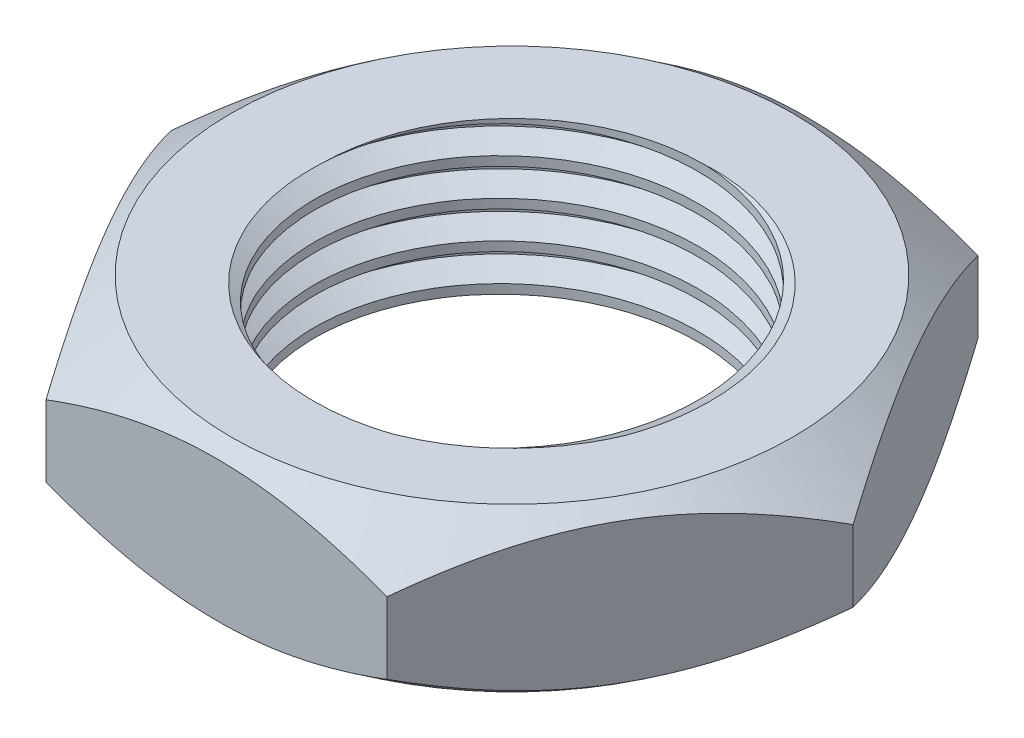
ISO-10303-21;
HEADER;
FILE_DESCRIPTION(('STEP AP214'),'2;1');
FILE_NAME('part.step','',(''),(''),'','','');
FILE_SCHEMA(('AUTOMOTIVE_DESIGN { 1 0 10303 214 1 1 1 1 }'));
ENDSEC;
DATA;
#1=APPLICATION_CONTEXT('core data for automotive mechanical design processes');
#2=APPLICATION_PROTOCOL_DEFINITION('international standard','automotive_design',2000,#1);
#3=PRODUCT_CONTEXT('',#1,'mechanical');
#4=PRODUCT('Part','Part','',(#3));
#5=PRODUCT_RELATED_PRODUCT_CATEGORY('part','',(#4));
#6=PRODUCT_DEFINITION_FORMATION('','',#4);
#7=PRODUCT_DEFINITION_CONTEXT('part definition',#1,'design');
#8=PRODUCT_DEFINITION('design','',#6,#7);
#9=PRODUCT_DEFINITION_SHAPE('','',#8);
#10=(LENGTH_UNIT() NAMED_UNIT(*) SI_UNIT(.MILLI.,.METRE.));
#11=(NAMED_UNIT(*) PLANE_ANGLE_UNIT() SI_UNIT($,.RADIAN.));
#12=(NAMED_UNIT(*) SI_UNIT($,.STERADIAN.) SOLID_ANGLE_UNIT());
#13=UNCERTAINTY_MEASURE_WITH_UNIT(LENGTH_MEASURE(1.E-05),#10,'distance_accuracy_value','');
#14=(GEOMETRIC_REPRESENTATION_CONTEXT(3) GLOBAL_UNCERTAINTY_ASSIGNED_CONTEXT((#13)) GLOBAL_UNIT_ASSIGNED_CONTEXT((#10,
#11,#12)) REPRESENTATION_CONTEXT('',''));
#15=CARTESIAN_POINT('',(0.,0.,0.));
#16=DIRECTION('',(0.,0.,1.));
#17=DIRECTION('',(1.,0.,0.));
#18=AXIS2_PLACEMENT_3D('',#15,#16,#17);
#19=CARTESIAN_POINT('',(0.,2.2,0.));
#20=DIRECTION('',(0.,1.,0.));
#21=DIRECTION('',(0.,0.,1.));
#22=AXIS2_PLACEMENT_3D('',#19,#20,#21);
#23=PLANE('',#22);
#24=CARTESIAN_POINT('',(0.,2.2,0.));
#25=DIRECTION('',(0.,1.,0.));
#26=DIRECTION('',(0.,0.,1.));
#27=AXIS2_PLACEMENT_3D('',#24,#25,#26);
#28=CIRCLE('',#27,2.6);
#29=CARTESIAN_POINT('',(4.26065128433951E-08,2.2,-2.6));
#30=VERTEX_POINT('',#29);
#31=CARTESIAN_POINT('',(-2.6,2.2,0.));
#32=VERTEX_POINT('',#31);
#33=EDGE_CURVE('E139',#30,#32,#28,.T.);
#34=ORIENTED_EDGE('',*,*,#33,.F.);
#35=CARTESIAN_POINT('',(2.64595693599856,2.2,1.11330380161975));
#36=CARTESIAN_POINT('',(2.66601771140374,2.2,1.0580840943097));
#37=CARTESIAN_POINT('',(2.68438719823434,2.2,1.00225097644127));
#38=CARTESIAN_POINT('',(2.71768098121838,2.2,0.889583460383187));
#39=CARTESIAN_POINT('',(2.73260622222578,2.2,0.832749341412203));
#40=CARTESIAN_POINT('',(2.75899326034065,2.2,0.718130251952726));
#41=CARTESIAN_POINT('',(2.77044621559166,2.2,0.660343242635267));
#42=CARTESIAN_POINT('',(2.78979766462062,2.2,0.544168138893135));
#43=CARTESIAN_POINT('',(2.79769533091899,2.2,0.485779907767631));
#44=CARTESIAN_POINT('',(2.81204340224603,2.2,0.348089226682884));
#45=CARTESIAN_POINT('',(2.81701764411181,2.2,0.268625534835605));
#46=CARTESIAN_POINT('',(2.81954000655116,2.2,0.149345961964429));
#47=CARTESIAN_POINT('',(2.81955720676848,2.2,0.109565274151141));
#48=CARTESIAN_POINT('',(2.81796036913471,2.2,0.0300369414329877));
#49=CARTESIAN_POINT('',(2.81634636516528,2.2,-0.00971070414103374));
#50=CARTESIAN_POINT('',(2.80891021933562,2.2,-0.128770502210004));
#51=CARTESIAN_POINT('',(2.80049493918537,2.2,-0.207939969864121));
#52=CARTESIAN_POINT('',(2.77683251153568,2.2,-0.365211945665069));
#53=CARTESIAN_POINT('',(2.76158568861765,2.2,-0.443314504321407));
#54=CARTESIAN_POINT('',(2.70598469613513,2.2,-0.674098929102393));
#55=CARTESIAN_POINT('',(2.65568912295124,2.2,-0.824520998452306));
#56=CARTESIAN_POINT('',(2.52999999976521,2.2,-1.1144040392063));
#57=CARTESIAN_POINT('',(2.45460078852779,2.2,-1.25386252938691));
#58=CARTESIAN_POINT('',(2.28297608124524,2.2,-1.51458997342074));
#59=CARTESIAN_POINT('',(2.187300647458,2.2,-1.63621833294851));
#60=CARTESIAN_POINT('',(2.02962634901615,2.2,-1.8052112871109));
#61=CARTESIAN_POINT('',(1.97468157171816,2.2,-1.85932090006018));
#62=CARTESIAN_POINT('',(1.86041405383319,2.2,-1.96274017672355));
#63=CARTESIAN_POINT('',(1.80109113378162,2.2,-2.01204964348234));
#64=CARTESIAN_POINT('',(1.67846476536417,2.2,-2.10551767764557));
#65=CARTESIAN_POINT('',(1.61515866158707,2.2,-2.14967275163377));
#66=CARTESIAN_POINT('',(1.48505032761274,2.2,-2.23251210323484));
#67=CARTESIAN_POINT('',(1.41824814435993,2.2,-2.27119645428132));
#68=CARTESIAN_POINT('',(1.31578250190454,2.2,-2.32484045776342));
#69=CARTESIAN_POINT('',(1.28125148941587,2.2,-2.34199084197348));
#70=CARTESIAN_POINT('',(1.21145674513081,2.2,-2.37472179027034));
#71=CARTESIAN_POINT('',(1.17619307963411,2.2,-2.39030249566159));
#72=CARTESIAN_POINT('',(1.06942003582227,2.2,-2.43466950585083));
#73=CARTESIAN_POINT('',(0.996910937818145,2.2,-2.46108996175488));
#74=CARTESIAN_POINT('',(0.849117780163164,2.2,-2.50759960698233));
#75=CARTESIAN_POINT('',(0.773813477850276,2.2,-2.52762415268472));
#76=CARTESIAN_POINT('',(0.621707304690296,2.2,-2.56083303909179));
#77=CARTESIAN_POINT('',(0.544905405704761,2.2,-2.57401725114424));
#78=CARTESIAN_POINT('',(0.390175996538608,2.2,-2.59346279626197));
#79=CARTESIAN_POINT('',(0.312245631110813,2.2,-2.59970139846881));
#80=CARTESIAN_POINT('',(0.156145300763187,2.2,-2.60513923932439));
#81=CARTESIAN_POINT('',(0.0779753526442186,2.2,-2.60433896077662));
#82=CARTESIAN_POINT('',(4.26065129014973E-08,2.2,-2.6));
#83=B_SPLINE_CURVE_WITH_KNOTS('',3,(#35,#36,#37,#38,#39,#40,#41,#42,#43,#44,#45,#46,#47,#48,#49,
#50,#51,#52,#53,#54,#55,#56,#57,#58,#59,#60,#61,#62,#63,#64,#65,#66,#67,#68,#69,#70,#71,#72,#73,
#74,#75,#76,#77,#78,#79,#80,#81,#82),.UNSPECIFIED.,.F.,.F.,(4,2,2,2,2,2,2,2,2,2,2,2,2,2,2,2,2,2,
2,2,2,2,2,4),(0.,0.176223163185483,0.3523979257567,0.529017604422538,0.705678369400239,
0.944225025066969,1.06353925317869,1.1828510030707,1.42135350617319,1.65984467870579,
2.13307915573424,2.60642042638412,3.06826992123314,3.29939210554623,3.53052376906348,
3.76181118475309,3.99309549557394,4.10872946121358,4.22435300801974,4.45554046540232,
4.68899557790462,4.92245508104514,5.15667640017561,5.39088165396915),.UNSPECIFIED.);
#84=CARTESIAN_POINT('',(2.64595693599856,2.2,1.11330380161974));
#85=VERTEX_POINT('',#84);
#86=EDGE_CURVE('E345',#85,#30,#83,.T.);
#87=ORIENTED_EDGE('',*,*,#86,.F.);
#88=CARTESIAN_POINT('',(1.07648732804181,2.2,2.6611479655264));
#89=CARTESIAN_POINT('',(1.11511965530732,2.2,2.64552305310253));
#90=CARTESIAN_POINT('',(1.15341833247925,2.2,2.62905008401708));
#91=CARTESIAN_POINT('',(1.26749746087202,2.2,2.57700906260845));
#92=CARTESIAN_POINT('',(1.34214815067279,2.2,2.53892986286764));
#93=CARTESIAN_POINT('',(1.48790043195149,2.2,2.45636381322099));
#94=CARTESIAN_POINT('',(1.5589976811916,2.2,2.41186936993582));
#95=CARTESIAN_POINT('',(1.76083397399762,2.2,2.27287121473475));
#96=CARTESIAN_POINT('',(1.88603200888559,2.2,2.17012428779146));
#97=CARTESIAN_POINT('',(2.11748052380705,2.2,1.944972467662));
#98=CARTESIAN_POINT('',(2.2237123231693,2.2,1.8225484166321));
#99=CARTESIAN_POINT('',(2.38443112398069,2.2,1.60231081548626));
#100=CARTESIAN_POINT('',(2.44473535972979,2.2,1.50868636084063));
#101=CARTESIAN_POINT('',(2.55397858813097,2.2,1.31531658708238));
#102=CARTESIAN_POINT('',(2.60294385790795,2.2,1.21558611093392));
#103=CARTESIAN_POINT('',(2.64595693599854,2.2,1.11330380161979));
#104=B_SPLINE_CURVE_WITH_KNOTS('',3,(#88,#89,#90,#91,#92,#93,#94,#95,#96,#97,#98,#99,#100,#101,
#102,#103),.UNSPECIFIED.,.F.,.F.,(4,2,2,2,2,2,2,4),(0.,0.12502965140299,0.376081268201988,
0.627432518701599,1.11085318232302,1.59474739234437,1.92813187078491,2.26073584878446),.UNSPECIFIED.);
#105=CARTESIAN_POINT('',(1.07648732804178,2.2,2.66114796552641));
#106=VERTEX_POINT('',#105);
#107=EDGE_CURVE('E360',#106,#85,#104,.T.);
#108=ORIENTED_EDGE('',*,*,#107,.F.);
#109=CARTESIAN_POINT('',(-2.6,2.2,0.));
#110=CARTESIAN_POINT('',(-2.6056945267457,2.2,0.117671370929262));
#111=CARTESIAN_POINT('',(-2.6035263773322,2.2,0.235674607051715));
#112=CARTESIAN_POINT('',(-2.58367008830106,2.2,0.470479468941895));
#113=CARTESIAN_POINT('',(-2.5659675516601,2.2,0.587279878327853));
#114=CARTESIAN_POINT('',(-2.50833903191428,2.2,0.848909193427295));
#115=CARTESIAN_POINT('',(-2.46367806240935,2.2,0.992720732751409));
#116=CARTESIAN_POINT('',(-2.35086157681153,2.2,1.27079010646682));
#117=CARTESIAN_POINT('',(-2.2827008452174,2.2,1.40504581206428));
#118=CARTESIAN_POINT('',(-2.12474560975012,2.2,1.66026087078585));
#119=CARTESIAN_POINT('',(-2.03495243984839,2.2,1.78122104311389));
#120=CARTESIAN_POINT('',(-1.88612544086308,2.2,1.94996528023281));
#121=CARTESIAN_POINT('',(-1.83413622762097,2.2,2.00411677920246));
#122=CARTESIAN_POINT('',(-1.72577701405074,2.2,2.10786022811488));
#123=CARTESIAN_POINT('',(-1.66940738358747,2.2,2.157452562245));
#124=CARTESIAN_POINT('',(-1.55273714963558,2.2,2.25168925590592));
#125=CARTESIAN_POINT('',(-1.49243952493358,2.2,2.29633729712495));
#126=CARTESIAN_POINT('',(-1.39934198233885,2.2,2.35935889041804));
#127=CARTESIAN_POINT('',(-1.36786420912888,2.2,2.37970958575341));
#128=CARTESIAN_POINT('',(-1.30411567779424,2.2,2.41914091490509));
#129=CARTESIAN_POINT('',(-1.27184476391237,2.2,2.43822129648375));
#130=CARTESIAN_POINT('',(-1.17393097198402,2.2,2.49350206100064));
#131=CARTESIAN_POINT('',(-1.10717053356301,2.2,2.5277532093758));
#132=CARTESIAN_POINT('',(-0.971134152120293,2.2,2.59081864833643));
#133=CARTESIAN_POINT('',(-0.901857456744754,2.2,2.61963129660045));
#134=CARTESIAN_POINT('',(-0.685874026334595,2.2,2.69947198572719));
#135=CARTESIAN_POINT('',(-0.535636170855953,2.2,2.7412805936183));
#136=CARTESIAN_POINT('',(-0.230323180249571,2.2,2.7995089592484));
#137=CARTESIAN_POINT('',(-0.0752478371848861,2.2,2.81592762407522));
#138=CARTESIAN_POINT('',(0.164441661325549,2.2,2.8213896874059));
#139=CARTESIAN_POINT('',(0.248938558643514,2.2,2.8195024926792));
#140=CARTESIAN_POINT('',(0.417449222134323,2.2,2.80813877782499));
#141=CARTESIAN_POINT('',(0.501462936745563,2.2,2.79866146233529));
#142=CARTESIAN_POINT('',(0.668460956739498,2.2,2.77215948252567));
#143=CARTESIAN_POINT('',(0.751442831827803,2.2,2.75511956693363));
#144=CARTESIAN_POINT('',(0.91553499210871,2.2,2.71364286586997));
#145=CARTESIAN_POINT('',(0.996645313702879,2.19999999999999,2.68920622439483));
#146=CARTESIAN_POINT('',(1.07648732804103,2.19999999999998,2.66114796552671));
#147=B_SPLINE_CURVE_WITH_KNOTS('',3,(#109,#110,#111,#112,#113,#114,#115,#116,#117,#118,#119,
#120,#121,#122,#123,#124,#125,#126,#127,#128,#129,#130,#131,#132,#133,#134,#135,#136,#137,#138,
#139,#140,#141,#142,#143,#144,#145,#146),.UNSPECIFIED.,.F.,.F.,(4,2,2,2,2,2,2,2,2,2,2,2,2,2,2,2,
2,2,4),(0.,0.353080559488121,0.7064886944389,1.15602141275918,1.60565396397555,2.05525879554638,
2.28024415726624,2.50521054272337,2.73000826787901,2.84243049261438,2.95487497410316,
3.17970434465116,3.40460150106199,3.87015173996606,4.33572201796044,4.5889803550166,
4.84226523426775,5.09606324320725,5.34985631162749),.UNSPECIFIED.);
#148=EDGE_CURVE('E356',#32,#106,#147,.T.);
#149=ORIENTED_EDGE('',*,*,#148,.F.);
#150=EDGE_LOOP('',(#34,#87,#108,#149));
#151=FACE_BOUND('',#150,.T.);
#152=CARTESIAN_POINT('',(0.,2.2,0.));
#153=DIRECTION('',(0.,-1.,0.));
#154=DIRECTION('',(0.,0.,-1.));
#155=AXIS2_PLACEMENT_3D('',#152,#153,#154);
#156=CIRCLE('',#155,3.80000000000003);
#157=CARTESIAN_POINT('',(0.,2.2,-3.80000000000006));
#158=VERTEX_POINT('',#157);
#159=EDGE_CURVE('E473',#158,#158,#156,.T.);
#160=ORIENTED_EDGE('',*,*,#159,.F.);
#161=EDGE_LOOP('',(#160));
#162=FACE_BOUND('',#161,.T.);
#163=ADVANCED_FACE('F40',(#151,#162),#23,.T.);
#164=CARTESIAN_POINT('',(0.,0.,0.));
#165=DIRECTION('',(0.,1.,0.));
#166=DIRECTION('',(0.,0.,1.));
#167=AXIS2_PLACEMENT_3D('',#164,#165,#166);
#168=PLANE('',#167);
#169=CARTESIAN_POINT('',(-2.78490184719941,0.,0.696315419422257));
#170=CARTESIAN_POINT('',(-2.75091168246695,0.,0.808966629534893));
#171=CARTESIAN_POINT('',(-2.70984393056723,0.,0.919435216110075));
#172=CARTESIAN_POINT('',(-2.61427496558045,0.,1.13449394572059));
#173=CARTESIAN_POINT('',(-2.55976437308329,0.,1.23907992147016));
#174=CARTESIAN_POINT('',(-2.41683367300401,0.,1.47590323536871));
#175=CARTESIAN_POINT('',(-2.32321952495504,0.,1.60504199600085));
#176=CARTESIAN_POINT('',(-2.11552101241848,0.,1.84587196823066));
#177=CARTESIAN_POINT('',(-2.0014219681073,0.,1.95755055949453));
#178=CARTESIAN_POINT('',(-1.81754877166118,0.,2.10946050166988));
#179=CARTESIAN_POINT('',(-1.75409234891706,0.,2.15752151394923));
#180=CARTESIAN_POINT('',(-1.62335902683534,0.,2.24811655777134));
#181=CARTESIAN_POINT('',(-1.55608337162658,0.,2.2906523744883));
#182=CARTESIAN_POINT('',(-1.41821374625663,0.,2.36993170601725));
#183=CARTESIAN_POINT('',(-1.34762030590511,0.,2.40667614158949));
#184=CARTESIAN_POINT('',(-1.20344398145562,0.,2.47373146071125));
#185=CARTESIAN_POINT('',(-1.1298614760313,0.,2.50404315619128));
#186=CARTESIAN_POINT('',(-0.981597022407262,0.,2.5575551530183));
#187=CARTESIAN_POINT('',(-0.906956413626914,0.,2.58086990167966));
#188=CARTESIAN_POINT('',(-0.755943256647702,0.,2.62090349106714));
#189=CARTESIAN_POINT('',(-0.679570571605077,0.,2.63762180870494));
#190=CARTESIAN_POINT('',(-0.448724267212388,0.,2.67765308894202));
#191=CARTESIAN_POINT('',(-0.292368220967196,0.,2.69089786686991));
#192=CARTESIAN_POINT('',(0.0148024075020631,0.,2.69002638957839));
#193=CARTESIAN_POINT('',(0.165624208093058,0.,2.67682739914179));
#194=CARTESIAN_POINT('',(0.46301434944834,0.,2.6252520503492));
#195=CARTESIAN_POINT('',(0.609582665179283,0.,2.5868755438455));
#196=CARTESIAN_POINT('',(0.823424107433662,0.,2.51115615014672));
#197=CARTESIAN_POINT('',(0.893984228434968,0.,2.48273356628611));
#198=CARTESIAN_POINT('',(1.03244697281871,0.,2.42000288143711));
#199=CARTESIAN_POINT('',(1.10035042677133,0.,2.38569663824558));
#200=CARTESIAN_POINT('',(1.19985951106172,0.,2.32999681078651));
#201=CARTESIAN_POINT('',(1.2326629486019,0.,2.31070669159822));
#202=CARTESIAN_POINT('',(1.29741650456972,0.,2.27075745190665));
#203=CARTESIAN_POINT('',(1.32936687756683,0.,2.25009874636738));
#204=CARTESIAN_POINT('',(1.39230764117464,0.,2.20735497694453));
#205=CARTESIAN_POINT('',(1.42329785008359,0.,2.18526964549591));
#206=CARTESIAN_POINT('',(1.48426758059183,0.,2.13972125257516));
#207=CARTESIAN_POINT('',(1.51424670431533,0.,2.11625765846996));
#208=CARTESIAN_POINT('',(1.54368598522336,0.,2.09213612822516));
#209=B_SPLINE_CURVE_WITH_KNOTS('',3,(#169,#170,#171,#172,#173,#174,#175,#176,#177,#178,#179,
#180,#181,#182,#183,#184,#185,#186,#187,#188,#189,#190,#191,#192,#193,#194,#195,#196,#197,#198,
#199,#200,#201,#202,#203,#204,#205,#206,#207,#208),.UNSPECIFIED.,.F.,.F.,(4,2,2,2,2,2,2,2,2,2,2,
2,2,2,2,2,2,2,2,4),(0.,0.352689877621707,0.705626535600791,1.18181763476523,1.65835135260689,
1.89692303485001,2.13541744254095,2.37387389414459,2.61230023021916,2.84658242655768,
3.08088319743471,3.54899976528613,4.00115966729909,4.45332222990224,4.6813129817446,
4.90923187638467,5.02337016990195,5.13747401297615,5.25159931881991,5.36576902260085),.UNSPECIFIED.);
#210=CARTESIAN_POINT('',(-2.78490184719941,0.,0.696315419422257));
#211=VERTEX_POINT('',#210);
#212=CARTESIAN_POINT('',(1.54368598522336,0.,2.09213612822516));
#213=VERTEX_POINT('',#212);
#214=EDGE_CURVE('E337',#211,#213,#209,.T.);
#215=ORIENTED_EDGE('',*,*,#214,.T.);
#216=CARTESIAN_POINT('',(0.,0.,0.));
#217=DIRECTION('',(0.,1.,0.));
#218=DIRECTION('',(0.,0.,1.));
#219=AXIS2_PLACEMENT_3D('',#216,#217,#218);
#220=CIRCLE('',#219,2.6);
#221=CARTESIAN_POINT('',(2.10344942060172,9.42472231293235E-05,-1.52823445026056));
#222=VERTEX_POINT('',#221);
#223=EDGE_CURVE('E144',#213,#222,#220,.T.);
#224=ORIENTED_EDGE('',*,*,#223,.T.);
#225=CARTESIAN_POINT('',(2.10397787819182,0.,-1.52861826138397));
#226=CARTESIAN_POINT('',(2.03997491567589,0.,-1.62782118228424));
#227=CARTESIAN_POINT('',(1.96918545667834,0.,-1.72250867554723));
#228=CARTESIAN_POINT('',(1.85386442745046,0.,-1.8566045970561));
#229=CARTESIAN_POINT('',(1.81390429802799,0.,-1.89997801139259));
#230=CARTESIAN_POINT('',(1.7311069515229,0.,-1.98389335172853));
#231=CARTESIAN_POINT('',(1.68826949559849,0.,-2.02443504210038));
#232=CARTESIAN_POINT('',(1.58838095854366,0.,-2.11268557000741));
#233=CARTESIAN_POINT('',(1.53053742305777,0.,-2.15950471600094));
#234=CARTESIAN_POINT('',(1.44092326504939,0.,-2.22585972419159));
#235=CARTESIAN_POINT('',(1.41056997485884,0.,-2.24733680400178));
#236=CARTESIAN_POINT('',(1.3489602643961,0.,-2.28895465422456));
#237=CARTESIAN_POINT('',(1.31770382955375,0.,-2.30909540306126));
#238=CARTESIAN_POINT('',(1.22270214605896,0.,-2.36760318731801));
#239=CARTESIAN_POINT('',(1.15775149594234,0.,-2.40403594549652));
#240=CARTESIAN_POINT('',(1.02509970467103,0.,-2.47146147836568));
#241=CARTESIAN_POINT('',(0.957398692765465,0.,-2.50245450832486));
#242=CARTESIAN_POINT('',(0.819356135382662,0.,-2.55893751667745));
#243=CARTESIAN_POINT('',(0.749003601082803,0.,-2.58440073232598));
#244=CARTESIAN_POINT('',(0.606465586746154,0.,-2.62946025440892));
#245=CARTESIAN_POINT('',(0.534280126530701,0.,-2.64905662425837));
#246=CARTESIAN_POINT('',(0.315694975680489,0.,-2.69882092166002));
#247=CARTESIAN_POINT('',(0.167139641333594,0.,-2.7200158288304));
#248=CARTESIAN_POINT('',(-0.135175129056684,0.,-2.73800915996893));
#249=CARTESIAN_POINT('',(-0.28897044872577,0.,-2.73416931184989));
#250=CARTESIAN_POINT('',(-0.593770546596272,0.,-2.70069742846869));
#251=CARTESIAN_POINT('',(-0.744776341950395,0.,-2.67107499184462));
#252=CARTESIAN_POINT('',(-0.96575185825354,0.,-2.60804163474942));
#253=CARTESIAN_POINT('',(-1.03849822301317,0.,-2.58392576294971));
#254=CARTESIAN_POINT('',(-1.18172471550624,0.,-2.52965790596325));
#255=CARTESIAN_POINT('',(-1.25220493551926,0.,-2.49950616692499));
#256=CARTESIAN_POINT('',(-1.3904330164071,0.,-2.43335390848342));
#257=CARTESIAN_POINT('',(-1.45817825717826,0.,-2.39734793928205));
#258=CARTESIAN_POINT('',(-1.59060361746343,0.,-2.32007254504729));
#259=CARTESIAN_POINT('',(-1.65528326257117,0.,-2.27880230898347));
#260=CARTESIAN_POINT('',(-1.78966136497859,0.,-2.18526725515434));
#261=CARTESIAN_POINT('',(-1.85885231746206,0.,-2.1322704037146));
#262=CARTESIAN_POINT('',(-1.99213690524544,0.,-2.02021399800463));
#263=CARTESIAN_POINT('',(-2.05623030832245,0.,-1.96115416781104));
#264=CARTESIAN_POINT('',(-2.1787612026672,0.,-1.83747518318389));
#265=CARTESIAN_POINT('',(-2.2372007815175,0.,-1.77285809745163));
#266=CARTESIAN_POINT('',(-2.34798382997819,0.,-1.63858251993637));
#267=CARTESIAN_POINT('',(-2.40032663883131,0.,-1.56892348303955));
#268=CARTESIAN_POINT('',(-2.44938111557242,0.,-1.4970189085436));
#269=B_SPLINE_CURVE_WITH_KNOTS('',3,(#225,#226,#227,#228,#229,#230,#231,#232,#233,#234,#235,
#236,#237,#238,#239,#240,#241,#242,#243,#244,#245,#246,#247,#248,#249,#250,#251,#252,#253,#254,
#255,#256,#257,#258,#259,#260,#261,#262,#263,#264,#265,#266,#267,#268),.UNSPECIFIED.,.F.,.F.,(4,
2,2,2,2,2,2,2,2,2,2,2,2,2,2,2,2,2,2,2,2,4),(0.,0.353639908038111,0.530435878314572,
0.707246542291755,0.930186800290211,1.04170673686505,1.1532284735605,1.37637205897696,
1.59950517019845,1.82369523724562,2.04788288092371,2.49585198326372,2.95528613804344,
3.41454932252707,3.64424693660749,3.87393518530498,4.10383849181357,4.33377726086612,
4.59487308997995,4.85598080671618,5.11699174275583,5.3780309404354),.UNSPECIFIED.);
#270=CARTESIAN_POINT('',(-2.44938111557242,0.,-1.4970189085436));
#271=VERTEX_POINT('',#270);
#272=EDGE_CURVE('E344',#222,#271,#269,.T.);
#273=ORIENTED_EDGE('',*,*,#272,.T.);
#274=CARTESIAN_POINT('',(-2.44938111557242,0.,-1.49701890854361));
#275=CARTESIAN_POINT('',(-2.4711151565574,0.,-1.46146295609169));
#276=CARTESIAN_POINT('',(-2.49207618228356,0.,-1.42542432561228));
#277=CARTESIAN_POINT('',(-2.55274183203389,0.,-1.3156879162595));
#278=CARTESIAN_POINT('',(-2.59004356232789,0.,-1.24064533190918));
#279=CARTESIAN_POINT('',(-2.65798004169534,0.,-1.08752608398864));
#280=CARTESIAN_POINT('',(-2.68860683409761,0.,-1.0094459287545));
#281=CARTESIAN_POINT('',(-2.76799925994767,0.,-0.777597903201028));
#282=CARTESIAN_POINT('',(-2.80740539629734,0.,-0.62050648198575));
#283=CARTESIAN_POINT('',(-2.85929287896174,0.,-0.30180830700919));
#284=CARTESIAN_POINT('',(-2.87174669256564,0.,-0.140197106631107));
#285=CARTESIAN_POINT('',(-2.86971364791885,0.,0.135068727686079));
#286=CARTESIAN_POINT('',(-2.86208697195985,0.,0.248814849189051));
#287=CARTESIAN_POINT('',(-2.83345287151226,0.,0.474344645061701));
#288=CARTESIAN_POINT('',(-2.81247612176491,0.,0.586132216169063));
#289=CARTESIAN_POINT('',(-2.78490184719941,0.,0.696315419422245));
#290=B_SPLINE_CURVE_WITH_KNOTS('',3,(#274,#275,#276,#277,#278,#279,#280,#281,#282,#283,#284,
#285,#286,#287,#288,#289),.UNSPECIFIED.,.F.,.F.,(4,2,2,2,2,2,2,4),(0.,0.125029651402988,
0.376082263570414,0.627432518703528,1.11084316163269,1.59474739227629,1.93598687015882,
2.27644509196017),.UNSPECIFIED.);
#291=EDGE_CURVE('E159',#271,#211,#290,.T.);
#292=ORIENTED_EDGE('',*,*,#291,.T.);
#293=EDGE_LOOP('',(#215,#224,#273,#292));
#294=FACE_BOUND('',#293,.T.);
#295=CARTESIAN_POINT('',(0.,0.,0.));
#296=DIRECTION('',(0.,-1.,0.));
#297=DIRECTION('',(0.,0.,-1.));
#298=AXIS2_PLACEMENT_3D('',#295,#296,#297);
#299=CIRCLE('',#298,3.80000000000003);
#300=CARTESIAN_POINT('',(0.,0.,-3.80000000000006));
#301=VERTEX_POINT('',#300);
#302=EDGE_CURVE('E471',#301,#301,#299,.T.);
#303=ORIENTED_EDGE('',*,*,#302,.T.);
#304=EDGE_LOOP('',(#303));
#305=FACE_BOUND('',#304,.T.);
#306=ADVANCED_FACE('F349',(#294,#305),#168,.F.);
#307=CARTESIAN_POINT('',(0.,2.2,0.));
#308=DIRECTION('',(0.,-1.,0.));
#309=DIRECTION('',(0.,0.,-1.));
#310=AXIS2_PLACEMENT_3D('',#307,#308,#309);
#311=CYLINDRICAL_SURFACE('',#310,2.6);
#312=CARTESIAN_POINT('',(-2.6,2.32500000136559,0.));
#313=CARTESIAN_POINT('',(-2.6,2.28333333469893,-1.50111069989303));
#314=CARTESIAN_POINT('',(-1.3,2.24166666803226,-2.25166604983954));
#315=CARTESIAN_POINT('',(0.,2.20000000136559,-3.00222139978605));
#316=CARTESIAN_POINT('',(1.3,2.15833333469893,-2.25166604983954));
#317=CARTESIAN_POINT('',(2.6,2.11666666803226,-1.50111069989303));
#318=CARTESIAN_POINT('',(2.6,2.07500000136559,0.));
#319=CARTESIAN_POINT('',(2.6,2.03333333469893,1.50111069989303));
#320=CARTESIAN_POINT('',(1.3,1.99166666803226,2.25166604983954));
#321=CARTESIAN_POINT('',(0.,1.95000000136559,3.00222139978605));
#322=CARTESIAN_POINT('',(-1.3,1.90833333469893,2.25166604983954));
#323=CARTESIAN_POINT('',(-2.6,1.86666666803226,1.50111069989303));
#324=CARTESIAN_POINT('',(-2.6,1.82500000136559,0.));
#325=CARTESIAN_POINT('',(-2.6,1.78333333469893,-1.50111069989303));
#326=CARTESIAN_POINT('',(-1.3,1.74166666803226,-2.25166604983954));
#327=CARTESIAN_POINT('',(0.,1.70000000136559,-3.00222139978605));
#328=CARTESIAN_POINT('',(1.3,1.65833333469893,-2.25166604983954));
#329=CARTESIAN_POINT('',(2.6,1.61666666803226,-1.50111069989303));
#330=CARTESIAN_POINT('',(2.6,1.57500000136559,0.));
#331=CARTESIAN_POINT('',(2.6,1.53333333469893,1.50111069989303));
#332=CARTESIAN_POINT('',(1.3,1.49166666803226,2.25166604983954));
#333=CARTESIAN_POINT('',(0.,1.45000000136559,3.00222139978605));
#334=CARTESIAN_POINT('',(-1.3,1.40833333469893,2.25166604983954));
#335=CARTESIAN_POINT('',(-2.6,1.36666666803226,1.50111069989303));
#336=CARTESIAN_POINT('',(-2.6,1.32500000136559,0.));
#337=CARTESIAN_POINT('',(-2.6,1.28333333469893,-1.50111069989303));
#338=CARTESIAN_POINT('',(-1.3,1.24166666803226,-2.25166604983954));
#339=CARTESIAN_POINT('',(0.,1.20000000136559,-3.00222139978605));
#340=CARTESIAN_POINT('',(1.3,1.15833333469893,-2.25166604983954));
#341=CARTESIAN_POINT('',(2.6,1.11666666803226,-1.50111069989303));
#342=CARTESIAN_POINT('',(2.6,1.07500000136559,0.));
#343=CARTESIAN_POINT('',(2.6,1.03333333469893,1.50111069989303));
#344=CARTESIAN_POINT('',(1.3,0.99166666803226,2.25166604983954));
#345=CARTESIAN_POINT('',(0.,0.950000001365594,3.00222139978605));
#346=CARTESIAN_POINT('',(-1.3,0.908333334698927,2.25166604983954));
#347=CARTESIAN_POINT('',(-2.6,0.86666666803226,1.50111069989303));
#348=CARTESIAN_POINT('',(-2.6,0.825000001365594,0.));
#349=CARTESIAN_POINT('',(-2.6,0.783333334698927,-1.50111069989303));
#350=CARTESIAN_POINT('',(-1.3,0.74166666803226,-2.25166604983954));
#351=CARTESIAN_POINT('',(0.,0.700000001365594,-3.00222139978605));
#352=CARTESIAN_POINT('',(1.3,0.658333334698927,-2.25166604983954));
#353=CARTESIAN_POINT('',(2.6,0.61666666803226,-1.50111069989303));
#354=CARTESIAN_POINT('',(2.6,0.575000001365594,0.));
#355=CARTESIAN_POINT('',(2.6,0.533333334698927,1.50111069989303));
#356=CARTESIAN_POINT('',(1.3,0.49166666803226,2.25166604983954));
#357=CARTESIAN_POINT('',(0.,0.450000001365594,3.00222139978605));
#358=CARTESIAN_POINT('',(-1.3,0.408333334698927,2.25166604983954));
#359=CARTESIAN_POINT('',(-2.6,0.36666666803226,1.50111069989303));
#360=CARTESIAN_POINT('',(-2.6,0.325000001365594,0.));
#361=CARTESIAN_POINT('',(-2.6,0.283333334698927,-1.50111069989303));
#362=CARTESIAN_POINT('',(-1.3,0.24166666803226,-2.25166604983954));
#363=CARTESIAN_POINT('',(0.,0.200000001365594,-3.00222139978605));
#364=CARTESIAN_POINT('',(1.3,0.158333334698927,-2.25166604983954));
#365=CARTESIAN_POINT('',(2.6,0.11666666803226,-1.50111069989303));
#366=CARTESIAN_POINT('',(2.6,0.0750000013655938,0.));
#367=CARTESIAN_POINT('',(2.6,0.033333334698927,1.50111069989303));
#368=CARTESIAN_POINT('',(1.3,-0.00833333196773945,2.25166604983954));
#369=CARTESIAN_POINT('',(0.,-0.0499999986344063,3.00222139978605));
#370=CARTESIAN_POINT('',(-1.3,-0.0916666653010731,2.25166604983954));
#371=CARTESIAN_POINT('',(-2.6,-0.13333333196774,1.50111069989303));
#372=CARTESIAN_POINT('',(-2.6,-0.174999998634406,0.));
#373=CARTESIAN_POINT('',(-2.6,-0.216666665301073,-1.50111069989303));
#374=CARTESIAN_POINT('',(-1.3,-0.25833333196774,-2.25166604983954));
#375=CARTESIAN_POINT('',(0.,-0.299999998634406,-3.00222139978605));
#376=CARTESIAN_POINT('',(1.3,-0.341666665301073,-2.25166604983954));
#377=CARTESIAN_POINT('',(1.77860974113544,-0.357006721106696,-1.97534058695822));
#378=CARTESIAN_POINT('',(2.10344853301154,-0.374622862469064,-1.52823567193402));
#379=(BOUNDED_CURVE() B_SPLINE_CURVE(2,(#312,#313,#314,#315,#316,#317,#318,#319,#320,#321,#322,
#323,#324,#325,#326,#327,#328,#329,#330,#331,#332,#333,#334,#335,#336,#337,#338,#339,#340,#341,
#342,#343,#344,#345,#346,#347,#348,#349,#350,#351,#352,#353,#354,#355,#356,#357,#358,#359,#360,
#361,#362,#363,#364,#365,#366,#367,#368,#369,#370,#371,#372,#373,#374,#375,#376,#377,#378),
.UNSPECIFIED.,.F.,.F.) B_SPLINE_CURVE_WITH_KNOTS((3,2,2,2,2,2,2,2,2,2,2,2,2,2,2,2,2,2,2,2,2,2,2,
2,2,2,2,2,2,2,2,2,2,3),(0.,0.0277777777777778,0.0555555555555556,0.0833333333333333,
0.111111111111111,0.138888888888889,0.166666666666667,0.194444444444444,0.222222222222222,0.25,
0.277777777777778,0.305555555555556,0.333333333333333,0.361111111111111,0.388888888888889,
0.416666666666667,0.444444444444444,0.472222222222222,0.5,0.527777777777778,0.555555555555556,
0.583333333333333,0.611111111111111,0.638888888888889,0.666666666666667,0.694444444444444,
0.722222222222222,0.75,0.777777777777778,0.805555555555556,0.833333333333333,0.861111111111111,
0.888888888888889,0.900061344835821),
.UNSPECIFIED.) CURVE() GEOMETRIC_REPRESENTATION_ITEM() RATIONAL_B_SPLINE_CURVE((1.,
0.866025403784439,1.,0.866025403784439,1.,0.866025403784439,1.,0.866025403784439,1.,
0.866025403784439,1.,0.866025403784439,1.,0.866025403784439,1.,0.866025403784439,1.,
0.866025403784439,1.,0.866025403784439,1.,0.866025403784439,1.,0.866025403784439,1.,
0.866025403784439,1.,0.866025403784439,1.,0.866025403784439,1.,0.866025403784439,1.,
0.866025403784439,1.,0.866025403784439,1.,0.866025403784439,1.,0.866025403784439,1.,
0.866025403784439,1.,0.866025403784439,1.,0.866025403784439,1.,0.866025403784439,1.,
0.866025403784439,1.,0.866025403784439,1.,0.866025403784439,1.,0.866025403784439,1.,
0.866025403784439,1.,0.866025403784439,1.,0.866025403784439,1.,0.866025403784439,1.,
0.94611429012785,0.935575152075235)) REPRESENTATION_ITEM(''));
#380=EDGE_CURVE('E318',#30,#213,#379,.T.);
#381=ORIENTED_EDGE('',*,*,#380,.F.);
#382=ORIENTED_EDGE('',*,*,#33,.T.);
#383=CARTESIAN_POINT('',(-2.6,2.7,0.));
#384=CARTESIAN_POINT('',(-2.6,2.65833333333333,-1.50111069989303));
#385=CARTESIAN_POINT('',(-1.3,2.61666666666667,-2.25166604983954));
#386=CARTESIAN_POINT('',(0.,2.575,-3.00222139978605));
#387=CARTESIAN_POINT('',(1.3,2.53333333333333,-2.25166604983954));
#388=CARTESIAN_POINT('',(2.6,2.49166666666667,-1.50111069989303));
#389=CARTESIAN_POINT('',(2.6,2.45,0.));
#390=CARTESIAN_POINT('',(2.6,2.40833333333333,1.50111069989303));
#391=CARTESIAN_POINT('',(1.3,2.36666666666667,2.25166604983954));
#392=CARTESIAN_POINT('',(0.,2.325,3.00222139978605));
#393=CARTESIAN_POINT('',(-1.3,2.28333333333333,2.25166604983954));
#394=CARTESIAN_POINT('',(-2.6,2.24166666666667,1.50111069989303));
#395=CARTESIAN_POINT('',(-2.6,2.2,0.));
#396=CARTESIAN_POINT('',(-2.6,2.15833333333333,-1.50111069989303));
#397=CARTESIAN_POINT('',(-1.3,2.11666666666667,-2.25166604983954));
#398=CARTESIAN_POINT('',(0.,2.075,-3.00222139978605));
#399=CARTESIAN_POINT('',(1.3,2.03333333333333,-2.25166604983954));
#400=CARTESIAN_POINT('',(2.6,1.99166666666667,-1.50111069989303));
#401=CARTESIAN_POINT('',(2.6,1.95,0.));
#402=CARTESIAN_POINT('',(2.6,1.90833333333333,1.50111069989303));
#403=CARTESIAN_POINT('',(1.3,1.86666666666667,2.25166604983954));
#404=CARTESIAN_POINT('',(0.,1.825,3.00222139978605));
#405=CARTESIAN_POINT('',(-1.3,1.78333333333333,2.25166604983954));
#406=CARTESIAN_POINT('',(-2.6,1.74166666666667,1.50111069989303));
#407=CARTESIAN_POINT('',(-2.6,1.7,0.));
#408=CARTESIAN_POINT('',(-2.6,1.65833333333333,-1.50111069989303));
#409=CARTESIAN_POINT('',(-1.3,1.61666666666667,-2.25166604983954));
#410=CARTESIAN_POINT('',(0.,1.575,-3.00222139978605));
#411=CARTESIAN_POINT('',(1.3,1.53333333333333,-2.25166604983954));
#412=CARTESIAN_POINT('',(2.6,1.49166666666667,-1.50111069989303));
#413=CARTESIAN_POINT('',(2.6,1.45,0.));
#414=CARTESIAN_POINT('',(2.6,1.40833333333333,1.50111069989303));
#415=CARTESIAN_POINT('',(1.3,1.36666666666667,2.25166604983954));
#416=CARTESIAN_POINT('',(0.,1.325,3.00222139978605));
#417=CARTESIAN_POINT('',(-1.3,1.28333333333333,2.25166604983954));
#418=CARTESIAN_POINT('',(-2.6,1.24166666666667,1.50111069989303));
#419=CARTESIAN_POINT('',(-2.6,1.2,0.));
#420=CARTESIAN_POINT('',(-2.6,1.15833333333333,-1.50111069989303));
#421=CARTESIAN_POINT('',(-1.3,1.11666666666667,-2.25166604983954));
#422=CARTESIAN_POINT('',(0.,1.075,-3.00222139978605));
#423=CARTESIAN_POINT('',(1.3,1.03333333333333,-2.25166604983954));
#424=CARTESIAN_POINT('',(2.6,0.991666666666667,-1.50111069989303));
#425=CARTESIAN_POINT('',(2.6,0.95,0.));
#426=CARTESIAN_POINT('',(2.6,0.908333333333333,1.50111069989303));
#427=CARTESIAN_POINT('',(1.3,0.866666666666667,2.25166604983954));
#428=CARTESIAN_POINT('',(0.,0.825,3.00222139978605));
#429=CARTESIAN_POINT('',(-1.3,0.783333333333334,2.25166604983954));
#430=CARTESIAN_POINT('',(-2.6,0.741666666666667,1.50111069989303));
#431=CARTESIAN_POINT('',(-2.6,0.7,0.));
#432=CARTESIAN_POINT('',(-2.6,0.658333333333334,-1.50111069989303));
#433=CARTESIAN_POINT('',(-1.3,0.616666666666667,-2.25166604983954));
#434=CARTESIAN_POINT('',(0.,0.575,-3.00222139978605));
#435=CARTESIAN_POINT('',(1.3,0.533333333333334,-2.25166604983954));
#436=CARTESIAN_POINT('',(2.6,0.491666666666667,-1.50111069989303));
#437=CARTESIAN_POINT('',(2.6,0.45,0.));
#438=CARTESIAN_POINT('',(2.6,0.408333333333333,1.50111069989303));
#439=CARTESIAN_POINT('',(1.3,0.366666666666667,2.25166604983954));
#440=CARTESIAN_POINT('',(0.,0.325,3.00222139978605));
#441=CARTESIAN_POINT('',(-1.3,0.283333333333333,2.25166604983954));
#442=CARTESIAN_POINT('',(-2.6,0.241666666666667,1.50111069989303));
#443=CARTESIAN_POINT('',(-2.6,0.2,0.));
#444=CARTESIAN_POINT('',(-2.6,0.158333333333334,-1.50111069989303));
#445=CARTESIAN_POINT('',(-1.3,0.116666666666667,-2.25166604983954));
#446=CARTESIAN_POINT('',(0.,0.0750000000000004,-3.00222139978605));
#447=CARTESIAN_POINT('',(1.3,0.0333333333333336,-2.25166604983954));
#448=CARTESIAN_POINT('',(1.77861183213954,0.0179932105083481,-1.97533937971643));
#449=CARTESIAN_POINT('',(2.10345124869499,0.000376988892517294,-1.52823193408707));
#450=(BOUNDED_CURVE() B_SPLINE_CURVE(2,(#383,#384,#385,#386,#387,#388,#389,#390,#391,#392,#393,
#394,#395,#396,#397,#398,#399,#400,#401,#402,#403,#404,#405,#406,#407,#408,#409,#410,#411,#412,
#413,#414,#415,#416,#417,#418,#419,#420,#421,#422,#423,#424,#425,#426,#427,#428,#429,#430,#431,
#432,#433,#434,#435,#436,#437,#438,#439,#440,#441,#442,#443,#444,#445,#446,#447,#448,#449),
.UNSPECIFIED.,.F.,.F.) B_SPLINE_CURVE_WITH_KNOTS((3,2,2,2,2,2,2,2,2,2,2,2,2,2,2,2,2,2,2,2,2,2,2,
2,2,2,2,2,2,2,2,2,2,3),(0.,0.0277777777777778,0.0555555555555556,0.0833333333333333,
0.111111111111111,0.138888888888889,0.166666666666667,0.194444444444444,0.222222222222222,0.25,
0.277777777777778,0.305555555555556,0.333333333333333,0.361111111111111,0.388888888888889,
0.416666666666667,0.444444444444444,0.472222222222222,0.5,0.527777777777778,0.555555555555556,
0.583333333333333,0.611111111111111,0.638888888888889,0.666666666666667,0.694444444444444,
0.722222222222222,0.75,0.777777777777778,0.805555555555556,0.833333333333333,0.861111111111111,
0.888888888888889,0.900061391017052),
.UNSPECIFIED.) CURVE() GEOMETRIC_REPRESENTATION_ITEM() RATIONAL_B_SPLINE_CURVE((1.,
0.866025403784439,1.,0.866025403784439,1.,0.866025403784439,1.,0.866025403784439,1.,
0.866025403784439,1.,0.866025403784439,1.,0.866025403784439,1.,0.866025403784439,1.,
0.866025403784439,1.,0.866025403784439,1.,0.866025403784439,1.,0.866025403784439,1.,
0.866025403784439,1.,0.866025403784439,1.,0.866025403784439,1.,0.866025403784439,1.,
0.866025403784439,1.,0.866025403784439,1.,0.866025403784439,1.,0.866025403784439,1.,
0.866025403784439,1.,0.866025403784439,1.,0.866025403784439,1.,0.866025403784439,1.,
0.866025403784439,1.,0.866025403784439,1.,0.866025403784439,1.,0.866025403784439,1.,
0.866025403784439,1.,0.866025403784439,1.,0.866025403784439,1.,0.866025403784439,1.,
0.946114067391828,0.93557506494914)) REPRESENTATION_ITEM(''));
#451=EDGE_CURVE('E314',#32,#222,#450,.T.);
#452=ORIENTED_EDGE('',*,*,#451,.T.);
#453=ORIENTED_EDGE('',*,*,#223,.F.);
#454=EDGE_LOOP('',(#381,#382,#452,#453));
#455=FACE_BOUND('',#454,.T.);
#456=ADVANCED_FACE('F382',(#455),#311,.F.);
#457=CARTESIAN_POINT('',(-2.8706329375,2.4812500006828,0.));
#458=CARTESIAN_POINT('',(-2.8706329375,2.43958333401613,-1.65736069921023));
#459=CARTESIAN_POINT('',(-1.43531646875,2.39791666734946,-2.48604104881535));
#460=CARTESIAN_POINT('',(0.,2.3562500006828,-3.31472139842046));
#461=CARTESIAN_POINT('',(1.43531646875,2.31458333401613,-2.48604104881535));
#462=CARTESIAN_POINT('',(2.8706329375,2.27291666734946,-1.65736069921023));
#463=CARTESIAN_POINT('',(2.8706329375,2.2312500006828,0.));
#464=CARTESIAN_POINT('',(2.8706329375,2.18958333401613,1.65736069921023));
#465=CARTESIAN_POINT('',(1.43531646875,2.14791666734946,2.48604104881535));
#466=CARTESIAN_POINT('',(0.,2.1062500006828,3.31472139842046));
#467=CARTESIAN_POINT('',(-1.43531646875,2.06458333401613,2.48604104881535));
#468=CARTESIAN_POINT('',(-2.8706329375,2.02291666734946,1.65736069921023));
#469=CARTESIAN_POINT('',(-2.8706329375,1.9812500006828,0.));
#470=CARTESIAN_POINT('',(-2.8706329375,1.93958333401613,-1.65736069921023));
#471=CARTESIAN_POINT('',(-1.43531646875,1.89791666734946,-2.48604104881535));
#472=CARTESIAN_POINT('',(0.,1.8562500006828,-3.31472139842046));
#473=CARTESIAN_POINT('',(1.43531646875,1.81458333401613,-2.48604104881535));
#474=CARTESIAN_POINT('',(2.8706329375,1.77291666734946,-1.65736069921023));
#475=CARTESIAN_POINT('',(2.8706329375,1.7312500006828,0.));
#476=CARTESIAN_POINT('',(2.8706329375,1.68958333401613,1.65736069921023));
#477=CARTESIAN_POINT('',(1.43531646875,1.64791666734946,2.48604104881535));
#478=CARTESIAN_POINT('',(0.,1.6062500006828,3.31472139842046));
#479=CARTESIAN_POINT('',(-1.43531646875,1.56458333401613,2.48604104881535));
#480=CARTESIAN_POINT('',(-2.8706329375,1.52291666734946,1.65736069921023));
#481=CARTESIAN_POINT('',(-2.8706329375,1.4812500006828,0.));
#482=CARTESIAN_POINT('',(-2.8706329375,1.43958333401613,-1.65736069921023));
#483=CARTESIAN_POINT('',(-1.43531646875,1.39791666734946,-2.48604104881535));
#484=CARTESIAN_POINT('',(0.,1.3562500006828,-3.31472139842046));
#485=CARTESIAN_POINT('',(1.43531646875,1.31458333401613,-2.48604104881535));
#486=CARTESIAN_POINT('',(2.8706329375,1.27291666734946,-1.65736069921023));
#487=CARTESIAN_POINT('',(2.8706329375,1.2312500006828,0.));
#488=CARTESIAN_POINT('',(2.8706329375,1.18958333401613,1.65736069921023));
#489=CARTESIAN_POINT('',(1.43531646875,1.14791666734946,2.48604104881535));
#490=CARTESIAN_POINT('',(0.,1.1062500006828,3.31472139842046));
#491=CARTESIAN_POINT('',(-1.43531646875,1.06458333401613,2.48604104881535));
#492=CARTESIAN_POINT('',(-2.8706329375,1.02291666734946,1.65736069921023));
#493=CARTESIAN_POINT('',(-2.8706329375,0.981250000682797,0.));
#494=CARTESIAN_POINT('',(-2.8706329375,0.93958333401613,-1.65736069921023));
#495=CARTESIAN_POINT('',(-1.43531646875,0.897916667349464,-2.48604104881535));
#496=CARTESIAN_POINT('',(0.,0.856250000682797,-3.31472139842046));
#497=CARTESIAN_POINT('',(1.43531646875,0.81458333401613,-2.48604104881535));
#498=CARTESIAN_POINT('',(2.8706329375,0.772916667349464,-1.65736069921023));
#499=CARTESIAN_POINT('',(2.8706329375,0.731250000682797,0.));
#500=CARTESIAN_POINT('',(2.8706329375,0.68958333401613,1.65736069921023));
#501=CARTESIAN_POINT('',(1.43531646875,0.647916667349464,2.48604104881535));
#502=CARTESIAN_POINT('',(0.,0.606250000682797,3.31472139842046));
#503=CARTESIAN_POINT('',(-1.43531646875,0.56458333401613,2.48604104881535));
#504=CARTESIAN_POINT('',(-2.8706329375,0.522916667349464,1.65736069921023));
#505=CARTESIAN_POINT('',(-2.8706329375,0.481250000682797,0.));
#506=CARTESIAN_POINT('',(-2.8706329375,0.439583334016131,-1.65736069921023));
#507=CARTESIAN_POINT('',(-1.43531646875,0.397916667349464,-2.48604104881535));
#508=CARTESIAN_POINT('',(0.,0.356250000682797,-3.31472139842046));
#509=CARTESIAN_POINT('',(1.43531646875,0.314583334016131,-2.48604104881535));
#510=CARTESIAN_POINT('',(2.8706329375,0.272916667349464,-1.65736069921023));
#511=CARTESIAN_POINT('',(2.8706329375,0.231250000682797,0.));
#512=CARTESIAN_POINT('',(2.8706329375,0.18958333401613,1.65736069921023));
#513=CARTESIAN_POINT('',(1.43531646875,0.147916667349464,2.48604104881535));
#514=CARTESIAN_POINT('',(0.,0.106250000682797,3.31472139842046));
#515=CARTESIAN_POINT('',(-1.43531646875,0.0645833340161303,2.48604104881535));
#516=CARTESIAN_POINT('',(-2.8706329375,0.0229166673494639,1.65736069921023));
#517=CARTESIAN_POINT('',(-2.8706329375,-0.018749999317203,0.));
#518=CARTESIAN_POINT('',(-2.8706329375,-0.0604166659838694,-1.65736069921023));
#519=CARTESIAN_POINT('',(-1.43531646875,-0.102083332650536,-2.48604104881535));
#520=CARTESIAN_POINT('',(0.,-0.143749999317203,-3.31472139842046));
#521=CARTESIAN_POINT('',(1.43531646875,-0.185416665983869,-2.48604104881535));
#522=CARTESIAN_POINT('',(1.96374450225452,-0.200756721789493,-2.18095298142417));
#523=CARTESIAN_POINT('',(2.32239563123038,-0.218372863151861,-1.68730909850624));
#524=CARTESIAN_POINT('',(-2.6,2.32500000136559,0.));
#525=CARTESIAN_POINT('',(-2.6,2.28333333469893,-1.50111069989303));
#526=CARTESIAN_POINT('',(-1.3,2.24166666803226,-2.25166604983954));
#527=CARTESIAN_POINT('',(0.,2.20000000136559,-3.00222139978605));
#528=CARTESIAN_POINT('',(1.3,2.15833333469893,-2.25166604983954));
#529=CARTESIAN_POINT('',(2.6,2.11666666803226,-1.50111069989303));
#530=CARTESIAN_POINT('',(2.6,2.07500000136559,0.));
#531=CARTESIAN_POINT('',(2.6,2.03333333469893,1.50111069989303));
#532=CARTESIAN_POINT('',(1.3,1.99166666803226,2.25166604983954));
#533=CARTESIAN_POINT('',(0.,1.95000000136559,3.00222139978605));
#534=CARTESIAN_POINT('',(-1.3,1.90833333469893,2.25166604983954));
#535=CARTESIAN_POINT('',(-2.6,1.86666666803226,1.50111069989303));
#536=CARTESIAN_POINT('',(-2.6,1.82500000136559,0.));
#537=CARTESIAN_POINT('',(-2.6,1.78333333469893,-1.50111069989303));
#538=CARTESIAN_POINT('',(-1.3,1.74166666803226,-2.25166604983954));
#539=CARTESIAN_POINT('',(0.,1.70000000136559,-3.00222139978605));
#540=CARTESIAN_POINT('',(1.3,1.65833333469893,-2.25166604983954));
#541=CARTESIAN_POINT('',(2.6,1.61666666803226,-1.50111069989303));
#542=CARTESIAN_POINT('',(2.6,1.57500000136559,0.));
#543=CARTESIAN_POINT('',(2.6,1.53333333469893,1.50111069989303));
#544=CARTESIAN_POINT('',(1.3,1.49166666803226,2.25166604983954));
#545=CARTESIAN_POINT('',(0.,1.45000000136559,3.00222139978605));
#546=CARTESIAN_POINT('',(-1.3,1.40833333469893,2.25166604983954));
#547=CARTESIAN_POINT('',(-2.6,1.36666666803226,1.50111069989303));
#548=CARTESIAN_POINT('',(-2.6,1.32500000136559,0.));
#549=CARTESIAN_POINT('',(-2.6,1.28333333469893,-1.50111069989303));
#550=CARTESIAN_POINT('',(-1.3,1.24166666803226,-2.25166604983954));
#551=CARTESIAN_POINT('',(0.,1.20000000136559,-3.00222139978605));
#552=CARTESIAN_POINT('',(1.3,1.15833333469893,-2.25166604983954));
#553=CARTESIAN_POINT('',(2.6,1.11666666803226,-1.50111069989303));
#554=CARTESIAN_POINT('',(2.6,1.07500000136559,0.));
#555=CARTESIAN_POINT('',(2.6,1.03333333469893,1.50111069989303));
#556=CARTESIAN_POINT('',(1.3,0.99166666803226,2.25166604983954));
#557=CARTESIAN_POINT('',(0.,0.950000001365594,3.00222139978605));
#558=CARTESIAN_POINT('',(-1.3,0.908333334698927,2.25166604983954));
#559=CARTESIAN_POINT('',(-2.6,0.86666666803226,1.50111069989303));
#560=CARTESIAN_POINT('',(-2.6,0.825000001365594,0.));
#561=CARTESIAN_POINT('',(-2.6,0.783333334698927,-1.50111069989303));
#562=CARTESIAN_POINT('',(-1.3,0.74166666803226,-2.25166604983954));
#563=CARTESIAN_POINT('',(0.,0.700000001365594,-3.00222139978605));
#564=CARTESIAN_POINT('',(1.3,0.658333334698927,-2.25166604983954));
#565=CARTESIAN_POINT('',(2.6,0.61666666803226,-1.50111069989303));
#566=CARTESIAN_POINT('',(2.6,0.575000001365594,0.));
#567=CARTESIAN_POINT('',(2.6,0.533333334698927,1.50111069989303));
#568=CARTESIAN_POINT('',(1.3,0.49166666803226,2.25166604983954));
#569=CARTESIAN_POINT('',(0.,0.450000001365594,3.00222139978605));
#570=CARTESIAN_POINT('',(-1.3,0.408333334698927,2.25166604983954));
#571=CARTESIAN_POINT('',(-2.6,0.36666666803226,1.50111069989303));
#572=CARTESIAN_POINT('',(-2.6,0.325000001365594,0.));
#573=CARTESIAN_POINT('',(-2.6,0.283333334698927,-1.50111069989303));
#574=CARTESIAN_POINT('',(-1.3,0.24166666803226,-2.25166604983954));
#575=CARTESIAN_POINT('',(0.,0.200000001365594,-3.00222139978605));
#576=CARTESIAN_POINT('',(1.3,0.158333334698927,-2.25166604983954));
#577=CARTESIAN_POINT('',(2.6,0.11666666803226,-1.50111069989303));
#578=CARTESIAN_POINT('',(2.6,0.0750000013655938,0.));
#579=CARTESIAN_POINT('',(2.6,0.033333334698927,1.50111069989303));
#580=CARTESIAN_POINT('',(1.3,-0.00833333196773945,2.25166604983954));
#581=CARTESIAN_POINT('',(0.,-0.0499999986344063,3.00222139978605));
#582=CARTESIAN_POINT('',(-1.3,-0.0916666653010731,2.25166604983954));
#583=CARTESIAN_POINT('',(-2.6,-0.13333333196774,1.50111069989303));
#584=CARTESIAN_POINT('',(-2.6,-0.174999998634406,0.));
#585=CARTESIAN_POINT('',(-2.6,-0.216666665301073,-1.50111069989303));
#586=CARTESIAN_POINT('',(-1.3,-0.25833333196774,-2.25166604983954));
#587=CARTESIAN_POINT('',(0.,-0.299999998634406,-3.00222139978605));
#588=CARTESIAN_POINT('',(1.3,-0.341666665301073,-2.25166604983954));
#589=CARTESIAN_POINT('',(1.77860974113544,-0.357006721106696,-1.97534058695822));
#590=CARTESIAN_POINT('',(2.10344853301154,-0.374622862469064,-1.52823567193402));
#591=(BOUNDED_SURFACE() B_SPLINE_SURFACE(1,2,((#457,#458,#459,#460,#461,#462,#463,#464,#465,
#466,#467,#468,#469,#470,#471,#472,#473,#474,#475,#476,#477,#478,#479,#480,#481,#482,#483,#484,
#485,#486,#487,#488,#489,#490,#491,#492,#493,#494,#495,#496,#497,#498,#499,#500,#501,#502,#503,
#504,#505,#506,#507,#508,#509,#510,#511,#512,#513,#514,#515,#516,#517,#518,#519,#520,#521,#522,
#523),(#524,#525,#526,#527,#528,#529,#530,#531,#532,#533,#534,#535,#536,#537,#538,#539,#540,
#541,#542,#543,#544,#545,#546,#547,#548,#549,#550,#551,#552,#553,#554,#555,#556,#557,#558,#559,
#560,#561,#562,#563,#564,#565,#566,#567,#568,#569,#570,#571,#572,#573,#574,#575,#576,#577,#578,
#579,#580,#581,#582,#583,#584,#585,#586,#587,#588,#589,#590)),.UNSPECIFIED.,.F.,.F.,
.F.) B_SPLINE_SURFACE_WITH_KNOTS((2,2),(3,2,2,2,2,2,2,2,2,2,2,2,2,2,2,2,2,2,2,2,2,2,2,2,2,2,2,2,
2,2,2,2,2,3),(0.,1.),(0.,0.0277777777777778,0.0555555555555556,0.0833333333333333,
0.111111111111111,0.138888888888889,0.166666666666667,0.194444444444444,0.222222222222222,0.25,
0.277777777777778,0.305555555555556,0.333333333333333,0.361111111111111,0.388888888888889,
0.416666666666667,0.444444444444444,0.472222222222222,0.5,0.527777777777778,0.555555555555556,
0.583333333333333,0.611111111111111,0.638888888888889,0.666666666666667,0.694444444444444,
0.722222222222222,0.75,0.777777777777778,0.805555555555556,0.833333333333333,0.861111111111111,
0.888888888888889,0.900061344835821),
.UNSPECIFIED.) GEOMETRIC_REPRESENTATION_ITEM() RATIONAL_B_SPLINE_SURFACE(((1.,0.866025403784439,
1.,0.866025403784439,1.,0.866025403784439,1.,0.866025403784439,1.,0.866025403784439,1.,
0.866025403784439,1.,0.866025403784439,1.,0.866025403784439,1.,0.866025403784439,1.,
0.866025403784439,1.,0.866025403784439,1.,0.866025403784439,1.,0.866025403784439,1.,
0.866025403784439,1.,0.866025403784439,1.,0.866025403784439,1.,0.866025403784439,1.,
0.866025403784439,1.,0.866025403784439,1.,0.866025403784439,1.,0.866025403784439,1.,
0.866025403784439,1.,0.866025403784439,1.,0.866025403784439,1.,0.866025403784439,1.,
0.866025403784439,1.,0.866025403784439,1.,0.866025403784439,1.,0.866025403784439,1.,
0.866025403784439,1.,0.866025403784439,1.,0.866025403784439,1.,0.94611429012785,
0.935575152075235),(1.,0.866025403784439,1.,0.866025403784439,1.,0.866025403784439,1.,
0.866025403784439,1.,0.866025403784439,1.,0.866025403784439,1.,0.866025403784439,1.,
0.866025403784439,1.,0.866025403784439,1.,0.866025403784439,1.,0.866025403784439,1.,
0.866025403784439,1.,0.866025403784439,1.,0.866025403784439,1.,0.866025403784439,1.,
0.866025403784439,1.,0.866025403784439,1.,0.866025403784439,1.,0.866025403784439,1.,
0.866025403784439,1.,0.866025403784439,1.,0.866025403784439,1.,0.866025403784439,1.,
0.866025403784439,1.,0.866025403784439,1.,0.866025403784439,1.,0.866025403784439,1.,
0.866025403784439,1.,0.866025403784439,1.,0.866025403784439,1.,0.866025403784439,1.,
0.866025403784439,1.,0.94611429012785,0.935575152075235))) REPRESENTATION_ITEM('') SURFACE());
#592=CARTESIAN_POINT('',(-2.8706329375,2.4812500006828,0.));
#593=CARTESIAN_POINT('',(-2.8706329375,2.43958333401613,-1.65736069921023));
#594=CARTESIAN_POINT('',(-1.43531646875,2.39791666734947,-2.48604104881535));
#595=CARTESIAN_POINT('',(0.,2.3562500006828,-3.31472139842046));
#596=CARTESIAN_POINT('',(1.43531646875,2.31458333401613,-2.48604104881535));
#597=CARTESIAN_POINT('',(2.8706329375,2.27291666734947,-1.65736069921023));
#598=CARTESIAN_POINT('',(2.8706329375,2.2312500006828,0.));
#599=CARTESIAN_POINT('',(2.8706329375,2.18958333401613,1.65736069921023));
#600=CARTESIAN_POINT('',(1.43531646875,2.14791666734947,2.48604104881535));
#601=CARTESIAN_POINT('',(0.,2.1062500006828,3.31472139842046));
#602=CARTESIAN_POINT('',(-1.43531646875,2.06458333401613,2.48604104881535));
#603=CARTESIAN_POINT('',(-2.8706329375,2.02291666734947,1.65736069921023));
#604=CARTESIAN_POINT('',(-2.8706329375,1.9812500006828,0.));
#605=CARTESIAN_POINT('',(-2.8706329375,1.93958333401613,-1.65736069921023));
#606=CARTESIAN_POINT('',(-1.43531646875,1.89791666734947,-2.48604104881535));
#607=CARTESIAN_POINT('',(0.,1.8562500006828,-3.31472139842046));
#608=CARTESIAN_POINT('',(1.43531646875,1.81458333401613,-2.48604104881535));
#609=CARTESIAN_POINT('',(2.8706329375,1.77291666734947,-1.65736069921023));
#610=CARTESIAN_POINT('',(2.8706329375,1.7312500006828,0.));
#611=CARTESIAN_POINT('',(2.8706329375,1.68958333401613,1.65736069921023));
#612=CARTESIAN_POINT('',(1.43531646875,1.64791666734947,2.48604104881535));
#613=CARTESIAN_POINT('',(0.,1.6062500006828,3.31472139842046));
#614=CARTESIAN_POINT('',(-1.43531646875,1.56458333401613,2.48604104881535));
#615=CARTESIAN_POINT('',(-2.8706329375,1.52291666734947,1.65736069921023));
#616=CARTESIAN_POINT('',(-2.8706329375,1.4812500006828,0.));
#617=CARTESIAN_POINT('',(-2.8706329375,1.43958333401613,-1.65736069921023));
#618=CARTESIAN_POINT('',(-1.43531646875,1.39791666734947,-2.48604104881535));
#619=CARTESIAN_POINT('',(0.,1.3562500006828,-3.31472139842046));
#620=CARTESIAN_POINT('',(1.43531646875,1.31458333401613,-2.48604104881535));
#621=CARTESIAN_POINT('',(2.8706329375,1.27291666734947,-1.65736069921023));
#622=CARTESIAN_POINT('',(2.8706329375,1.2312500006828,0.));
#623=CARTESIAN_POINT('',(2.8706329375,1.18958333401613,1.65736069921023));
#624=CARTESIAN_POINT('',(1.43531646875,1.14791666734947,2.48604104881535));
#625=CARTESIAN_POINT('',(0.,1.1062500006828,3.31472139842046));
#626=CARTESIAN_POINT('',(-1.43531646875,1.06458333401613,2.48604104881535));
#627=CARTESIAN_POINT('',(-2.8706329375,1.02291666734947,1.65736069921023));
#628=CARTESIAN_POINT('',(-2.8706329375,0.981250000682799,0.));
#629=CARTESIAN_POINT('',(-2.8706329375,0.939583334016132,-1.65736069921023));
#630=CARTESIAN_POINT('',(-1.43531646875,0.897916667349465,-2.48604104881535));
#631=CARTESIAN_POINT('',(0.,0.856250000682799,-3.31472139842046));
#632=CARTESIAN_POINT('',(1.43531646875,0.814583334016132,-2.48604104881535));
#633=CARTESIAN_POINT('',(2.8706329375,0.772916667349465,-1.65736069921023));
#634=CARTESIAN_POINT('',(2.8706329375,0.731250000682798,0.));
#635=CARTESIAN_POINT('',(2.8706329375,0.689583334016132,1.65736069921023));
#636=CARTESIAN_POINT('',(1.43531646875,0.647916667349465,2.48604104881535));
#637=CARTESIAN_POINT('',(0.,0.606250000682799,3.31472139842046));
#638=CARTESIAN_POINT('',(-1.43531646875,0.564583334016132,2.48604104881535));
#639=CARTESIAN_POINT('',(-2.8706329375,0.522916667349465,1.65736069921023));
#640=CARTESIAN_POINT('',(-2.8706329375,0.481250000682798,0.));
#641=CARTESIAN_POINT('',(-2.8706329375,0.439583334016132,-1.65736069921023));
#642=CARTESIAN_POINT('',(-1.43531646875,0.397916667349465,-2.48604104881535));
#643=CARTESIAN_POINT('',(0.,0.356250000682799,-3.31472139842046));
#644=CARTESIAN_POINT('',(1.43531646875,0.314583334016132,-2.48604104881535));
#645=CARTESIAN_POINT('',(2.8706329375,0.272916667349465,-1.65736069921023));
#646=CARTESIAN_POINT('',(2.8706329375,0.231250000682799,0.));
#647=CARTESIAN_POINT('',(2.8706329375,0.189583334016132,1.65736069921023));
#648=CARTESIAN_POINT('',(1.43531646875,0.147916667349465,2.48604104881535));
#649=CARTESIAN_POINT('',(0.,0.106250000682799,3.31472139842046));
#650=CARTESIAN_POINT('',(-1.43531646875,0.0645833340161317,2.48604104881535));
#651=CARTESIAN_POINT('',(-2.8706329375,0.0229166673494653,1.65736069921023));
#652=CARTESIAN_POINT('',(-2.8706329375,-0.0187499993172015,0.));
#653=CARTESIAN_POINT('',(-2.8706329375,-0.0604166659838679,-1.65736069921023));
#654=CARTESIAN_POINT('',(-1.43531646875,-0.102083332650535,-2.48604104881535));
#655=CARTESIAN_POINT('',(0.,-0.143749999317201,-3.31472139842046));
#656=CARTESIAN_POINT('',(1.43531646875,-0.185416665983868,-2.48604104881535));
#657=CARTESIAN_POINT('',(1.96374080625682,-0.200756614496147,-2.18095511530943));
#658=CARTESIAN_POINT('',(2.3223908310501,-0.218372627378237,-1.68731570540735));
#659=CARTESIAN_POINT('',(2.61457870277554,-0.232724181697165,-1.28515360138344));
#660=CARTESIAN_POINT('',(2.90676657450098,-0.247075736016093,-0.882991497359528));
#661=(BOUNDED_CURVE() B_SPLINE_CURVE(2,(#592,#593,#594,#595,#596,#597,#598,#599,#600,#601,#602,
#603,#604,#605,#606,#607,#608,#609,#610,#611,#612,#613,#614,#615,#616,#617,#618,#619,#620,#621,
#622,#623,#624,#625,#626,#627,#628,#629,#630,#631,#632,#633,#634,#635,#636,#637,#638,#639,#640,
#641,#642,#643,#644,#645,#646,#647,#648,#649,#650,#651,#652,#653,#654,#655,#656,#657,#658,#659,
#660),.UNSPECIFIED.,.F.,.F.) B_SPLINE_CURVE_WITH_KNOTS((3,2,2,2,2,2,2,2,2,2,2,2,2,2,2,2,2,2,2,2,
2,2,2,2,2,2,2,2,2,2,2,2,2,2,3),(0.,0.0277777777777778,0.0555555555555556,0.0833333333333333,
0.111111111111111,0.138888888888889,0.166666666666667,0.194444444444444,0.222222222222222,0.25,
0.277777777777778,0.305555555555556,0.333333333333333,0.361111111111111,0.388888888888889,
0.416666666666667,0.444444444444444,0.472222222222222,0.5,0.527777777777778,0.555555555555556,
0.583333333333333,0.611111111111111,0.638888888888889,0.666666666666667,0.694444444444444,
0.722222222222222,0.75,0.777777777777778,0.805555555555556,0.833333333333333,0.861111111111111,
0.888888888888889,0.900061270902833,0.909061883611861),
.UNSPECIFIED.) CURVE() GEOMETRIC_REPRESENTATION_ITEM() RATIONAL_B_SPLINE_CURVE((1.,
0.866025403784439,1.,0.866025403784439,1.,0.866025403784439,1.,0.866025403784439,1.,
0.866025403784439,1.,0.866025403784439,1.,0.866025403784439,1.,0.866025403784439,1.,
0.866025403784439,1.,0.866025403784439,1.,0.866025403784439,1.,0.866025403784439,1.,
0.866025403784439,1.,0.866025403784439,1.,0.866025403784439,1.,0.866025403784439,1.,
0.866025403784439,1.,0.866025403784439,1.,0.866025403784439,1.,0.866025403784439,1.,
0.866025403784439,1.,0.866025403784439,1.,0.866025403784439,1.,0.866025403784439,1.,
0.866025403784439,1.,0.866025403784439,1.,0.866025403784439,1.,0.866025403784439,1.,
0.866025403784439,1.,0.866025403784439,1.,0.866025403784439,1.,0.866025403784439,1.,
0.94611464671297,0.935575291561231,0.935575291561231,0.935575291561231)) REPRESENTATION_ITEM(''));
#662=EDGE_CURVE('E353',#85,#211,#661,.T.);
#663=ORIENTED_EDGE('',*,*,#662,.F.);
#664=ORIENTED_EDGE('',*,*,#86,.T.);
#665=ORIENTED_EDGE('',*,*,#380,.T.);
#666=ORIENTED_EDGE('',*,*,#214,.F.);
#667=EDGE_LOOP('',(#663,#664,#665,#666));
#668=FACE_BOUND('',#667,.T.);
#669=ADVANCED_FACE('F252',(#668),#591,.T.);
#670=CARTESIAN_POINT('',(-2.6,2.7,0.));
#671=CARTESIAN_POINT('',(-2.6,2.65833333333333,-1.50111069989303));
#672=CARTESIAN_POINT('',(-1.3,2.61666666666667,-2.25166604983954));
#673=CARTESIAN_POINT('',(0.,2.575,-3.00222139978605));
#674=CARTESIAN_POINT('',(1.3,2.53333333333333,-2.25166604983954));
#675=CARTESIAN_POINT('',(2.6,2.49166666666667,-1.50111069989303));
#676=CARTESIAN_POINT('',(2.6,2.45,0.));
#677=CARTESIAN_POINT('',(2.6,2.40833333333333,1.50111069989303));
#678=CARTESIAN_POINT('',(1.3,2.36666666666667,2.25166604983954));
#679=CARTESIAN_POINT('',(0.,2.325,3.00222139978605));
#680=CARTESIAN_POINT('',(-1.3,2.28333333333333,2.25166604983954));
#681=CARTESIAN_POINT('',(-2.6,2.24166666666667,1.50111069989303));
#682=CARTESIAN_POINT('',(-2.6,2.2,0.));
#683=CARTESIAN_POINT('',(-2.6,2.15833333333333,-1.50111069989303));
#684=CARTESIAN_POINT('',(-1.3,2.11666666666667,-2.25166604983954));
#685=CARTESIAN_POINT('',(0.,2.075,-3.00222139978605));
#686=CARTESIAN_POINT('',(1.3,2.03333333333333,-2.25166604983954));
#687=CARTESIAN_POINT('',(2.6,1.99166666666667,-1.50111069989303));
#688=CARTESIAN_POINT('',(2.6,1.95,0.));
#689=CARTESIAN_POINT('',(2.6,1.90833333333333,1.50111069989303));
#690=CARTESIAN_POINT('',(1.3,1.86666666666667,2.25166604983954));
#691=CARTESIAN_POINT('',(0.,1.825,3.00222139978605));
#692=CARTESIAN_POINT('',(-1.3,1.78333333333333,2.25166604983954));
#693=CARTESIAN_POINT('',(-2.6,1.74166666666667,1.50111069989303));
#694=CARTESIAN_POINT('',(-2.6,1.7,0.));
#695=CARTESIAN_POINT('',(-2.6,1.65833333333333,-1.50111069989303));
#696=CARTESIAN_POINT('',(-1.3,1.61666666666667,-2.25166604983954));
#697=CARTESIAN_POINT('',(0.,1.575,-3.00222139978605));
#698=CARTESIAN_POINT('',(1.3,1.53333333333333,-2.25166604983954));
#699=CARTESIAN_POINT('',(2.6,1.49166666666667,-1.50111069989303));
#700=CARTESIAN_POINT('',(2.6,1.45,0.));
#701=CARTESIAN_POINT('',(2.6,1.40833333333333,1.50111069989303));
#702=CARTESIAN_POINT('',(1.3,1.36666666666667,2.25166604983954));
#703=CARTESIAN_POINT('',(0.,1.325,3.00222139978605));
#704=CARTESIAN_POINT('',(-1.3,1.28333333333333,2.25166604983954));
#705=CARTESIAN_POINT('',(-2.6,1.24166666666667,1.50111069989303));
#706=CARTESIAN_POINT('',(-2.6,1.2,0.));
#707=CARTESIAN_POINT('',(-2.6,1.15833333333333,-1.50111069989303));
#708=CARTESIAN_POINT('',(-1.3,1.11666666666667,-2.25166604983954));
#709=CARTESIAN_POINT('',(0.,1.075,-3.00222139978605));
#710=CARTESIAN_POINT('',(1.3,1.03333333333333,-2.25166604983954));
#711=CARTESIAN_POINT('',(2.6,0.991666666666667,-1.50111069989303));
#712=CARTESIAN_POINT('',(2.6,0.95,0.));
#713=CARTESIAN_POINT('',(2.6,0.908333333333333,1.50111069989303));
#714=CARTESIAN_POINT('',(1.3,0.866666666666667,2.25166604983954));
#715=CARTESIAN_POINT('',(0.,0.825,3.00222139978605));
#716=CARTESIAN_POINT('',(-1.3,0.783333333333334,2.25166604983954));
#717=CARTESIAN_POINT('',(-2.6,0.741666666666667,1.50111069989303));
#718=CARTESIAN_POINT('',(-2.6,0.7,0.));
#719=CARTESIAN_POINT('',(-2.6,0.658333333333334,-1.50111069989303));
#720=CARTESIAN_POINT('',(-1.3,0.616666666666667,-2.25166604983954));
#721=CARTESIAN_POINT('',(0.,0.575,-3.00222139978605));
#722=CARTESIAN_POINT('',(1.3,0.533333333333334,-2.25166604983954));
#723=CARTESIAN_POINT('',(2.6,0.491666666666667,-1.50111069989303));
#724=CARTESIAN_POINT('',(2.6,0.45,0.));
#725=CARTESIAN_POINT('',(2.6,0.408333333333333,1.50111069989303));
#726=CARTESIAN_POINT('',(1.3,0.366666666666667,2.25166604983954));
#727=CARTESIAN_POINT('',(0.,0.325,3.00222139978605));
#728=CARTESIAN_POINT('',(-1.3,0.283333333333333,2.25166604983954));
#729=CARTESIAN_POINT('',(-2.6,0.241666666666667,1.50111069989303));
#730=CARTESIAN_POINT('',(-2.6,0.2,0.));
#731=CARTESIAN_POINT('',(-2.6,0.158333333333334,-1.50111069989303));
#732=CARTESIAN_POINT('',(-1.3,0.116666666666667,-2.25166604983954));
#733=CARTESIAN_POINT('',(0.,0.0750000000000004,-3.00222139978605));
#734=CARTESIAN_POINT('',(1.3,0.0333333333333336,-2.25166604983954));
#735=CARTESIAN_POINT('',(1.77861047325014,0.0179932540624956,-1.9753401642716));
#736=CARTESIAN_POINT('',(2.10344948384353,0.000377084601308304,-1.52823436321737));
#737=CARTESIAN_POINT('',(-2.8706329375,2.5437500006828,0.));
#738=CARTESIAN_POINT('',(-2.8706329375,2.50208333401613,-1.65736069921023));
#739=CARTESIAN_POINT('',(-1.43531646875,2.46041666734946,-2.48604104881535));
#740=CARTESIAN_POINT('',(0.,2.4187500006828,-3.31472139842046));
#741=CARTESIAN_POINT('',(1.43531646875,2.37708333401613,-2.48604104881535));
#742=CARTESIAN_POINT('',(2.8706329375,2.33541666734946,-1.65736069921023));
#743=CARTESIAN_POINT('',(2.8706329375,2.2937500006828,0.));
#744=CARTESIAN_POINT('',(2.8706329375,2.25208333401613,1.65736069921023));
#745=CARTESIAN_POINT('',(1.43531646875,2.21041666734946,2.48604104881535));
#746=CARTESIAN_POINT('',(0.,2.1687500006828,3.31472139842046));
#747=CARTESIAN_POINT('',(-1.43531646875,2.12708333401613,2.48604104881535));
#748=CARTESIAN_POINT('',(-2.8706329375,2.08541666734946,1.65736069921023));
#749=CARTESIAN_POINT('',(-2.8706329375,2.0437500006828,0.));
#750=CARTESIAN_POINT('',(-2.8706329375,2.00208333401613,-1.65736069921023));
#751=CARTESIAN_POINT('',(-1.43531646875,1.96041666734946,-2.48604104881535));
#752=CARTESIAN_POINT('',(0.,1.9187500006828,-3.31472139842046));
#753=CARTESIAN_POINT('',(1.43531646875,1.87708333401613,-2.48604104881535));
#754=CARTESIAN_POINT('',(2.8706329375,1.83541666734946,-1.65736069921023));
#755=CARTESIAN_POINT('',(2.8706329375,1.7937500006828,0.));
#756=CARTESIAN_POINT('',(2.8706329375,1.75208333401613,1.65736069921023));
#757=CARTESIAN_POINT('',(1.43531646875,1.71041666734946,2.48604104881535));
#758=CARTESIAN_POINT('',(0.,1.6687500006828,3.31472139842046));
#759=CARTESIAN_POINT('',(-1.43531646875,1.62708333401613,2.48604104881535));
#760=CARTESIAN_POINT('',(-2.8706329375,1.58541666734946,1.65736069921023));
#761=CARTESIAN_POINT('',(-2.8706329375,1.5437500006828,0.));
#762=CARTESIAN_POINT('',(-2.8706329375,1.50208333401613,-1.65736069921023));
#763=CARTESIAN_POINT('',(-1.43531646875,1.46041666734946,-2.48604104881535));
#764=CARTESIAN_POINT('',(0.,1.4187500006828,-3.31472139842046));
#765=CARTESIAN_POINT('',(1.43531646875,1.37708333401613,-2.48604104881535));
#766=CARTESIAN_POINT('',(2.8706329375,1.33541666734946,-1.65736069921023));
#767=CARTESIAN_POINT('',(2.8706329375,1.2937500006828,0.));
#768=CARTESIAN_POINT('',(2.8706329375,1.25208333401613,1.65736069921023));
#769=CARTESIAN_POINT('',(1.43531646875,1.21041666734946,2.48604104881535));
#770=CARTESIAN_POINT('',(0.,1.1687500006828,3.31472139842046));
#771=CARTESIAN_POINT('',(-1.43531646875,1.12708333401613,2.48604104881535));
#772=CARTESIAN_POINT('',(-2.8706329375,1.08541666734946,1.65736069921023));
#773=CARTESIAN_POINT('',(-2.8706329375,1.0437500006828,0.));
#774=CARTESIAN_POINT('',(-2.8706329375,1.00208333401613,-1.65736069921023));
#775=CARTESIAN_POINT('',(-1.43531646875,0.960416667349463,-2.48604104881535));
#776=CARTESIAN_POINT('',(0.,0.918750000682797,-3.31472139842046));
#777=CARTESIAN_POINT('',(1.43531646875,0.87708333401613,-2.48604104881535));
#778=CARTESIAN_POINT('',(2.8706329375,0.835416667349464,-1.65736069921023));
#779=CARTESIAN_POINT('',(2.8706329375,0.793750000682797,0.));
#780=CARTESIAN_POINT('',(2.8706329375,0.75208333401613,1.65736069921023));
#781=CARTESIAN_POINT('',(1.43531646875,0.710416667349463,2.48604104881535));
#782=CARTESIAN_POINT('',(0.,0.668750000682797,3.31472139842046));
#783=CARTESIAN_POINT('',(-1.43531646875,0.62708333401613,2.48604104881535));
#784=CARTESIAN_POINT('',(-2.8706329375,0.585416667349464,1.65736069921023));
#785=CARTESIAN_POINT('',(-2.8706329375,0.543750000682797,0.));
#786=CARTESIAN_POINT('',(-2.8706329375,0.50208333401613,-1.65736069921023));
#787=CARTESIAN_POINT('',(-1.43531646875,0.460416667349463,-2.48604104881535));
#788=CARTESIAN_POINT('',(0.,0.418750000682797,-3.31472139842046));
#789=CARTESIAN_POINT('',(1.43531646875,0.37708333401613,-2.48604104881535));
#790=CARTESIAN_POINT('',(2.8706329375,0.335416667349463,-1.65736069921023));
#791=CARTESIAN_POINT('',(2.8706329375,0.293750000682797,0.));
#792=CARTESIAN_POINT('',(2.8706329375,0.25208333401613,1.65736069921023));
#793=CARTESIAN_POINT('',(1.43531646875,0.210416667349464,2.48604104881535));
#794=CARTESIAN_POINT('',(0.,0.168750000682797,3.31472139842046));
#795=CARTESIAN_POINT('',(-1.43531646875,0.12708333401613,2.48604104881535));
#796=CARTESIAN_POINT('',(-2.8706329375,0.0854166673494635,1.65736069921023));
#797=CARTESIAN_POINT('',(-2.8706329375,0.0437500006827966,0.));
#798=CARTESIAN_POINT('',(-2.8706329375,0.00208333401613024,-1.65736069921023));
#799=CARTESIAN_POINT('',(-1.43531646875,-0.0395833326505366,-2.48604104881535));
#800=CARTESIAN_POINT('',(0.,-0.081249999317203,-3.31472139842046));
#801=CARTESIAN_POINT('',(1.43531646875,-0.12291666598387,-2.48604104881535));
#802=CARTESIAN_POINT('',(1.96374531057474,-0.138256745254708,-2.18095251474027));
#803=CARTESIAN_POINT('',(2.32239668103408,-0.155872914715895,-1.68730765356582));
#804=(BOUNDED_SURFACE() B_SPLINE_SURFACE(1,2,((#670,#671,#672,#673,#674,#675,#676,#677,#678,
#679,#680,#681,#682,#683,#684,#685,#686,#687,#688,#689,#690,#691,#692,#693,#694,#695,#696,#697,
#698,#699,#700,#701,#702,#703,#704,#705,#706,#707,#708,#709,#710,#711,#712,#713,#714,#715,#716,
#717,#718,#719,#720,#721,#722,#723,#724,#725,#726,#727,#728,#729,#730,#731,#732,#733,#734,#735,
#736),(#737,#738,#739,#740,#741,#742,#743,#744,#745,#746,#747,#748,#749,#750,#751,#752,#753,
#754,#755,#756,#757,#758,#759,#760,#761,#762,#763,#764,#765,#766,#767,#768,#769,#770,#771,#772,
#773,#774,#775,#776,#777,#778,#779,#780,#781,#782,#783,#784,#785,#786,#787,#788,#789,#790,#791,
#792,#793,#794,#795,#796,#797,#798,#799,#800,#801,#802,#803)),.UNSPECIFIED.,.F.,.F.,
.F.) B_SPLINE_SURFACE_WITH_KNOTS((2,2),(3,2,2,2,2,2,2,2,2,2,2,2,2,2,2,2,2,2,2,2,2,2,2,2,2,2,2,2,
2,2,2,2,2,3),(0.,1.),(0.,0.0277777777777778,0.0555555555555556,0.0833333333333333,
0.111111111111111,0.138888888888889,0.166666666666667,0.194444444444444,0.222222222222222,0.25,
0.277777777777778,0.305555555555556,0.333333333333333,0.361111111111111,0.388888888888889,
0.416666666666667,0.444444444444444,0.472222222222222,0.5,0.527777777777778,0.555555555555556,
0.583333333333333,0.611111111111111,0.638888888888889,0.666666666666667,0.694444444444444,
0.722222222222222,0.75,0.777777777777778,0.805555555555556,0.833333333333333,0.861111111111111,
0.888888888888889,0.900061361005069),
.UNSPECIFIED.) GEOMETRIC_REPRESENTATION_ITEM() RATIONAL_B_SPLINE_SURFACE(((1.,0.866025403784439,
1.,0.866025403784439,1.,0.866025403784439,1.,0.866025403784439,1.,0.866025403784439,1.,
0.866025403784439,1.,0.866025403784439,1.,0.866025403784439,1.,0.866025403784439,1.,
0.866025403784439,1.,0.866025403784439,1.,0.866025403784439,1.,0.866025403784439,1.,
0.866025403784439,1.,0.866025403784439,1.,0.866025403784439,1.,0.866025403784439,1.,
0.866025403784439,1.,0.866025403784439,1.,0.866025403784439,1.,0.866025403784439,1.,
0.866025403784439,1.,0.866025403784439,1.,0.866025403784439,1.,0.866025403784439,1.,
0.866025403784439,1.,0.866025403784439,1.,0.866025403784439,1.,0.866025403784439,1.,
0.866025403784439,1.,0.866025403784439,1.,0.866025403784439,1.,0.946114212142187,
0.935575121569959),(1.,0.866025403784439,1.,0.866025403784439,1.,0.866025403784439,1.,
0.866025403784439,1.,0.866025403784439,1.,0.866025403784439,1.,0.866025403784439,1.,
0.866025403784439,1.,0.866025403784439,1.,0.866025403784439,1.,0.866025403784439,1.,
0.866025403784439,1.,0.866025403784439,1.,0.866025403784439,1.,0.866025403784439,1.,
0.866025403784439,1.,0.866025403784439,1.,0.866025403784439,1.,0.866025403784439,1.,
0.866025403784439,1.,0.866025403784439,1.,0.866025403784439,1.,0.866025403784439,1.,
0.866025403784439,1.,0.866025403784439,1.,0.866025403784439,1.,0.866025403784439,1.,
0.866025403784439,1.,0.866025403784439,1.,0.866025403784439,1.,0.866025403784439,1.,
0.866025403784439,1.,0.946114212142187,0.935575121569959))) REPRESENTATION_ITEM('') SURFACE());
#805=CARTESIAN_POINT('',(-2.8706329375,2.5437500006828,0.));
#806=CARTESIAN_POINT('',(-2.8706329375,2.50208333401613,-1.65736069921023));
#807=CARTESIAN_POINT('',(-1.43531646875,2.46041666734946,-2.48604104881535));
#808=CARTESIAN_POINT('',(0.,2.4187500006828,-3.31472139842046));
#809=CARTESIAN_POINT('',(1.43531646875,2.37708333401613,-2.48604104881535));
#810=CARTESIAN_POINT('',(2.8706329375,2.33541666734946,-1.65736069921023));
#811=CARTESIAN_POINT('',(2.8706329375,2.2937500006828,0.));
#812=CARTESIAN_POINT('',(2.8706329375,2.25208333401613,1.65736069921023));
#813=CARTESIAN_POINT('',(1.43531646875,2.21041666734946,2.48604104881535));
#814=CARTESIAN_POINT('',(0.,2.1687500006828,3.31472139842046));
#815=CARTESIAN_POINT('',(-1.43531646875,2.12708333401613,2.48604104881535));
#816=CARTESIAN_POINT('',(-2.8706329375,2.08541666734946,1.65736069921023));
#817=CARTESIAN_POINT('',(-2.8706329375,2.0437500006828,0.));
#818=CARTESIAN_POINT('',(-2.8706329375,2.00208333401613,-1.65736069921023));
#819=CARTESIAN_POINT('',(-1.43531646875,1.96041666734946,-2.48604104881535));
#820=CARTESIAN_POINT('',(0.,1.9187500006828,-3.31472139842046));
#821=CARTESIAN_POINT('',(1.43531646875,1.87708333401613,-2.48604104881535));
#822=CARTESIAN_POINT('',(2.8706329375,1.83541666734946,-1.65736069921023));
#823=CARTESIAN_POINT('',(2.8706329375,1.7937500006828,0.));
#824=CARTESIAN_POINT('',(2.8706329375,1.75208333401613,1.65736069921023));
#825=CARTESIAN_POINT('',(1.43531646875,1.71041666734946,2.48604104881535));
#826=CARTESIAN_POINT('',(0.,1.6687500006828,3.31472139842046));
#827=CARTESIAN_POINT('',(-1.43531646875,1.62708333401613,2.48604104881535));
#828=CARTESIAN_POINT('',(-2.8706329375,1.58541666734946,1.65736069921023));
#829=CARTESIAN_POINT('',(-2.8706329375,1.5437500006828,0.));
#830=CARTESIAN_POINT('',(-2.8706329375,1.50208333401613,-1.65736069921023));
#831=CARTESIAN_POINT('',(-1.43531646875,1.46041666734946,-2.48604104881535));
#832=CARTESIAN_POINT('',(0.,1.4187500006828,-3.31472139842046));
#833=CARTESIAN_POINT('',(1.43531646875,1.37708333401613,-2.48604104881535));
#834=CARTESIAN_POINT('',(2.8706329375,1.33541666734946,-1.65736069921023));
#835=CARTESIAN_POINT('',(2.8706329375,1.2937500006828,0.));
#836=CARTESIAN_POINT('',(2.8706329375,1.25208333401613,1.65736069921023));
#837=CARTESIAN_POINT('',(1.43531646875,1.21041666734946,2.48604104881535));
#838=CARTESIAN_POINT('',(0.,1.1687500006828,3.31472139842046));
#839=CARTESIAN_POINT('',(-1.43531646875,1.12708333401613,2.48604104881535));
#840=CARTESIAN_POINT('',(-2.8706329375,1.08541666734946,1.65736069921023));
#841=CARTESIAN_POINT('',(-2.8706329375,1.0437500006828,0.));
#842=CARTESIAN_POINT('',(-2.8706329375,1.00208333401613,-1.65736069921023));
#843=CARTESIAN_POINT('',(-1.43531646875,0.960416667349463,-2.48604104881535));
#844=CARTESIAN_POINT('',(0.,0.918750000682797,-3.31472139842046));
#845=CARTESIAN_POINT('',(1.43531646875,0.87708333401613,-2.48604104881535));
#846=CARTESIAN_POINT('',(2.8706329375,0.835416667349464,-1.65736069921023));
#847=CARTESIAN_POINT('',(2.8706329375,0.793750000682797,0.));
#848=CARTESIAN_POINT('',(2.8706329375,0.75208333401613,1.65736069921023));
#849=CARTESIAN_POINT('',(1.43531646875,0.710416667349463,2.48604104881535));
#850=CARTESIAN_POINT('',(0.,0.668750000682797,3.31472139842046));
#851=CARTESIAN_POINT('',(-1.43531646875,0.62708333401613,2.48604104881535));
#852=CARTESIAN_POINT('',(-2.8706329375,0.585416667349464,1.65736069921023));
#853=CARTESIAN_POINT('',(-2.8706329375,0.543750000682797,0.));
#854=CARTESIAN_POINT('',(-2.8706329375,0.50208333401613,-1.65736069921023));
#855=CARTESIAN_POINT('',(-1.43531646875,0.460416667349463,-2.48604104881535));
#856=CARTESIAN_POINT('',(0.,0.418750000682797,-3.31472139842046));
#857=CARTESIAN_POINT('',(1.43531646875,0.37708333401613,-2.48604104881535));
#858=CARTESIAN_POINT('',(2.8706329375,0.335416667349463,-1.65736069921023));
#859=CARTESIAN_POINT('',(2.8706329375,0.293750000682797,0.));
#860=CARTESIAN_POINT('',(2.8706329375,0.25208333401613,1.65736069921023));
#861=CARTESIAN_POINT('',(1.43531646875,0.210416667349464,2.48604104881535));
#862=CARTESIAN_POINT('',(0.,0.168750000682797,3.31472139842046));
#863=CARTESIAN_POINT('',(-1.43531646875,0.12708333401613,2.48604104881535));
#864=CARTESIAN_POINT('',(-2.8706329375,0.0854166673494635,1.65736069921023));
#865=CARTESIAN_POINT('',(-2.8706329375,0.0437500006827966,0.));
#866=CARTESIAN_POINT('',(-2.8706329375,0.00208333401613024,-1.65736069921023));
#867=CARTESIAN_POINT('',(-1.43531646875,-0.0395833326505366,-2.48604104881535));
#868=CARTESIAN_POINT('',(0.,-0.081249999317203,-3.31472139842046));
#869=CARTESIAN_POINT('',(1.43531646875,-0.12291666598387,-2.48604104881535));
#870=CARTESIAN_POINT('',(1.96374531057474,-0.138256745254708,-2.18095251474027));
#871=CARTESIAN_POINT('',(2.32239668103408,-0.155872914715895,-1.68730765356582));
#872=(BOUNDED_CURVE() B_SPLINE_CURVE(2,(#805,#806,#807,#808,#809,#810,#811,#812,#813,#814,#815,
#816,#817,#818,#819,#820,#821,#822,#823,#824,#825,#826,#827,#828,#829,#830,#831,#832,#833,#834,
#835,#836,#837,#838,#839,#840,#841,#842,#843,#844,#845,#846,#847,#848,#849,#850,#851,#852,#853,
#854,#855,#856,#857,#858,#859,#860,#861,#862,#863,#864,#865,#866,#867,#868,#869,#870,#871),
.UNSPECIFIED.,.F.,.F.) B_SPLINE_CURVE_WITH_KNOTS((3,2,2,2,2,2,2,2,2,2,2,2,2,2,2,2,2,2,2,2,2,2,2,
2,2,2,2,2,2,2,2,2,2,3),(0.,0.0277777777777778,0.0555555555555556,0.0833333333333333,
0.111111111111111,0.138888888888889,0.166666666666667,0.194444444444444,0.222222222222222,0.25,
0.277777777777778,0.305555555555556,0.333333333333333,0.361111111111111,0.388888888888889,
0.416666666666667,0.444444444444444,0.472222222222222,0.5,0.527777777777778,0.555555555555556,
0.583333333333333,0.611111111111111,0.638888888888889,0.666666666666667,0.694444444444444,
0.722222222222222,0.75,0.777777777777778,0.805555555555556,0.833333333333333,0.861111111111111,
0.888888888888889,0.900061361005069),
.UNSPECIFIED.) CURVE() GEOMETRIC_REPRESENTATION_ITEM() RATIONAL_B_SPLINE_CURVE((1.,
0.866025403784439,1.,0.866025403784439,1.,0.866025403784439,1.,0.866025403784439,1.,
0.866025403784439,1.,0.866025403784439,1.,0.866025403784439,1.,0.866025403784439,1.,
0.866025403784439,1.,0.866025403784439,1.,0.866025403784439,1.,0.866025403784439,1.,
0.866025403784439,1.,0.866025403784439,1.,0.866025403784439,1.,0.866025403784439,1.,
0.866025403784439,1.,0.866025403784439,1.,0.866025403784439,1.,0.866025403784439,1.,
0.866025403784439,1.,0.866025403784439,1.,0.866025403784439,1.,0.866025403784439,1.,
0.866025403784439,1.,0.866025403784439,1.,0.866025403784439,1.,0.866025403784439,1.,
0.866025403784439,1.,0.866025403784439,1.,0.866025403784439,1.,0.866025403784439,1.,
0.946114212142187,0.935575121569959)) REPRESENTATION_ITEM(''));
#873=EDGE_CURVE('E236',#106,#271,#872,.T.);
#874=ORIENTED_EDGE('',*,*,#451,.F.);
#875=ORIENTED_EDGE('',*,*,#148,.T.);
#876=ORIENTED_EDGE('',*,*,#873,.T.);
#877=ORIENTED_EDGE('',*,*,#272,.F.);
#878=EDGE_LOOP('',(#874,#875,#876,#877));
#879=FACE_BOUND('',#878,.T.);
#880=ADVANCED_FACE('F275',(#879),#804,.T.);
#881=CARTESIAN_POINT('',(-2.8706329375,2.5437500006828,0.));
#882=CARTESIAN_POINT('',(-2.8706329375,2.50208333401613,-1.65736069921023));
#883=CARTESIAN_POINT('',(-1.43531646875,2.46041666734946,-2.48604104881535));
#884=CARTESIAN_POINT('',(0.,2.4187500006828,-3.31472139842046));
#885=CARTESIAN_POINT('',(1.43531646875,2.37708333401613,-2.48604104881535));
#886=CARTESIAN_POINT('',(2.8706329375,2.33541666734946,-1.65736069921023));
#887=CARTESIAN_POINT('',(2.8706329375,2.2937500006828,0.));
#888=CARTESIAN_POINT('',(2.8706329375,2.25208333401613,1.65736069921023));
#889=CARTESIAN_POINT('',(1.43531646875,2.21041666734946,2.48604104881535));
#890=CARTESIAN_POINT('',(0.,2.1687500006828,3.31472139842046));
#891=CARTESIAN_POINT('',(-1.43531646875,2.12708333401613,2.48604104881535));
#892=CARTESIAN_POINT('',(-2.8706329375,2.08541666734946,1.65736069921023));
#893=CARTESIAN_POINT('',(-2.8706329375,2.0437500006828,0.));
#894=CARTESIAN_POINT('',(-2.8706329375,2.00208333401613,-1.65736069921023));
#895=CARTESIAN_POINT('',(-1.43531646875,1.96041666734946,-2.48604104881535));
#896=CARTESIAN_POINT('',(0.,1.9187500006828,-3.31472139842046));
#897=CARTESIAN_POINT('',(1.43531646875,1.87708333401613,-2.48604104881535));
#898=CARTESIAN_POINT('',(2.8706329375,1.83541666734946,-1.65736069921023));
#899=CARTESIAN_POINT('',(2.8706329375,1.7937500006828,0.));
#900=CARTESIAN_POINT('',(2.8706329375,1.75208333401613,1.65736069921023));
#901=CARTESIAN_POINT('',(1.43531646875,1.71041666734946,2.48604104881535));
#902=CARTESIAN_POINT('',(0.,1.6687500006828,3.31472139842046));
#903=CARTESIAN_POINT('',(-1.43531646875,1.62708333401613,2.48604104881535));
#904=CARTESIAN_POINT('',(-2.8706329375,1.58541666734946,1.65736069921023));
#905=CARTESIAN_POINT('',(-2.8706329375,1.5437500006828,0.));
#906=CARTESIAN_POINT('',(-2.8706329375,1.50208333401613,-1.65736069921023));
#907=CARTESIAN_POINT('',(-1.43531646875,1.46041666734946,-2.48604104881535));
#908=CARTESIAN_POINT('',(0.,1.4187500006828,-3.31472139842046));
#909=CARTESIAN_POINT('',(1.43531646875,1.37708333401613,-2.48604104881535));
#910=CARTESIAN_POINT('',(2.8706329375,1.33541666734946,-1.65736069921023));
#911=CARTESIAN_POINT('',(2.8706329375,1.2937500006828,0.));
#912=CARTESIAN_POINT('',(2.8706329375,1.25208333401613,1.65736069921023));
#913=CARTESIAN_POINT('',(1.43531646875,1.21041666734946,2.48604104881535));
#914=CARTESIAN_POINT('',(0.,1.1687500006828,3.31472139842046));
#915=CARTESIAN_POINT('',(-1.43531646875,1.12708333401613,2.48604104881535));
#916=CARTESIAN_POINT('',(-2.8706329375,1.08541666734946,1.65736069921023));
#917=CARTESIAN_POINT('',(-2.8706329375,1.0437500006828,0.));
#918=CARTESIAN_POINT('',(-2.8706329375,1.00208333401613,-1.65736069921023));
#919=CARTESIAN_POINT('',(-1.43531646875,0.960416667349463,-2.48604104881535));
#920=CARTESIAN_POINT('',(0.,0.918750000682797,-3.31472139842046));
#921=CARTESIAN_POINT('',(1.43531646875,0.87708333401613,-2.48604104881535));
#922=CARTESIAN_POINT('',(2.8706329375,0.835416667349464,-1.65736069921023));
#923=CARTESIAN_POINT('',(2.8706329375,0.793750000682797,0.));
#924=CARTESIAN_POINT('',(2.8706329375,0.75208333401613,1.65736069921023));
#925=CARTESIAN_POINT('',(1.43531646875,0.710416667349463,2.48604104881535));
#926=CARTESIAN_POINT('',(0.,0.668750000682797,3.31472139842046));
#927=CARTESIAN_POINT('',(-1.43531646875,0.62708333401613,2.48604104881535));
#928=CARTESIAN_POINT('',(-2.8706329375,0.585416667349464,1.65736069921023));
#929=CARTESIAN_POINT('',(-2.8706329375,0.543750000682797,0.));
#930=CARTESIAN_POINT('',(-2.8706329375,0.50208333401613,-1.65736069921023));
#931=CARTESIAN_POINT('',(-1.43531646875,0.460416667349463,-2.48604104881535));
#932=CARTESIAN_POINT('',(0.,0.418750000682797,-3.31472139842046));
#933=CARTESIAN_POINT('',(1.43531646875,0.37708333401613,-2.48604104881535));
#934=CARTESIAN_POINT('',(2.8706329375,0.335416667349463,-1.65736069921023));
#935=CARTESIAN_POINT('',(2.8706329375,0.293750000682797,0.));
#936=CARTESIAN_POINT('',(2.8706329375,0.25208333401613,1.65736069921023));
#937=CARTESIAN_POINT('',(1.43531646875,0.210416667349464,2.48604104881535));
#938=CARTESIAN_POINT('',(0.,0.168750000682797,3.31472139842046));
#939=CARTESIAN_POINT('',(-1.43531646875,0.12708333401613,2.48604104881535));
#940=CARTESIAN_POINT('',(-2.8706329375,0.0854166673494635,1.65736069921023));
#941=CARTESIAN_POINT('',(-2.8706329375,0.0437500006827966,0.));
#942=CARTESIAN_POINT('',(-2.8706329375,0.00208333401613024,-1.65736069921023));
#943=CARTESIAN_POINT('',(-1.43531646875,-0.0395833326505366,-2.48604104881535));
#944=CARTESIAN_POINT('',(0.,-0.081249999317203,-3.31472139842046));
#945=CARTESIAN_POINT('',(1.43531646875,-0.12291666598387,-2.48604104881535));
#946=CARTESIAN_POINT('',(1.96374080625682,-0.138256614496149,-2.18095511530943));
#947=CARTESIAN_POINT('',(2.3223908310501,-0.155872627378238,-1.68731570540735));
#948=CARTESIAN_POINT('',(2.61457870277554,-0.170224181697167,-1.28515360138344));
#949=CARTESIAN_POINT('',(2.90676657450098,-0.184575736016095,-0.882991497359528));
#950=CARTESIAN_POINT('',(-2.8706329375,2.4812500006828,0.));
#951=CARTESIAN_POINT('',(-2.8706329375,2.43958333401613,-1.65736069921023));
#952=CARTESIAN_POINT('',(-1.43531646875,2.39791666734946,-2.48604104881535));
#953=CARTESIAN_POINT('',(0.,2.3562500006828,-3.31472139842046));
#954=CARTESIAN_POINT('',(1.43531646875,2.31458333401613,-2.48604104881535));
#955=CARTESIAN_POINT('',(2.8706329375,2.27291666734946,-1.65736069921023));
#956=CARTESIAN_POINT('',(2.8706329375,2.2312500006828,0.));
#957=CARTESIAN_POINT('',(2.8706329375,2.18958333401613,1.65736069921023));
#958=CARTESIAN_POINT('',(1.43531646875,2.14791666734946,2.48604104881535));
#959=CARTESIAN_POINT('',(0.,2.1062500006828,3.31472139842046));
#960=CARTESIAN_POINT('',(-1.43531646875,2.06458333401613,2.48604104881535));
#961=CARTESIAN_POINT('',(-2.8706329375,2.02291666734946,1.65736069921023));
#962=CARTESIAN_POINT('',(-2.8706329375,1.9812500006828,0.));
#963=CARTESIAN_POINT('',(-2.8706329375,1.93958333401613,-1.65736069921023));
#964=CARTESIAN_POINT('',(-1.43531646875,1.89791666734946,-2.48604104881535));
#965=CARTESIAN_POINT('',(0.,1.8562500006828,-3.31472139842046));
#966=CARTESIAN_POINT('',(1.43531646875,1.81458333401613,-2.48604104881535));
#967=CARTESIAN_POINT('',(2.8706329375,1.77291666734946,-1.65736069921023));
#968=CARTESIAN_POINT('',(2.8706329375,1.7312500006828,0.));
#969=CARTESIAN_POINT('',(2.8706329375,1.68958333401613,1.65736069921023));
#970=CARTESIAN_POINT('',(1.43531646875,1.64791666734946,2.48604104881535));
#971=CARTESIAN_POINT('',(0.,1.6062500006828,3.31472139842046));
#972=CARTESIAN_POINT('',(-1.43531646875,1.56458333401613,2.48604104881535));
#973=CARTESIAN_POINT('',(-2.8706329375,1.52291666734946,1.65736069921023));
#974=CARTESIAN_POINT('',(-2.8706329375,1.4812500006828,0.));
#975=CARTESIAN_POINT('',(-2.8706329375,1.43958333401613,-1.65736069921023));
#976=CARTESIAN_POINT('',(-1.43531646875,1.39791666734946,-2.48604104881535));
#977=CARTESIAN_POINT('',(0.,1.3562500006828,-3.31472139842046));
#978=CARTESIAN_POINT('',(1.43531646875,1.31458333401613,-2.48604104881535));
#979=CARTESIAN_POINT('',(2.8706329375,1.27291666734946,-1.65736069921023));
#980=CARTESIAN_POINT('',(2.8706329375,1.2312500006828,0.));
#981=CARTESIAN_POINT('',(2.8706329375,1.18958333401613,1.65736069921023));
#982=CARTESIAN_POINT('',(1.43531646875,1.14791666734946,2.48604104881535));
#983=CARTESIAN_POINT('',(0.,1.1062500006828,3.31472139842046));
#984=CARTESIAN_POINT('',(-1.43531646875,1.06458333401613,2.48604104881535));
#985=CARTESIAN_POINT('',(-2.8706329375,1.02291666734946,1.65736069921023));
#986=CARTESIAN_POINT('',(-2.8706329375,0.981250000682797,0.));
#987=CARTESIAN_POINT('',(-2.8706329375,0.93958333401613,-1.65736069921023));
#988=CARTESIAN_POINT('',(-1.43531646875,0.897916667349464,-2.48604104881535));
#989=CARTESIAN_POINT('',(0.,0.856250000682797,-3.31472139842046));
#990=CARTESIAN_POINT('',(1.43531646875,0.81458333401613,-2.48604104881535));
#991=CARTESIAN_POINT('',(2.8706329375,0.772916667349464,-1.65736069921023));
#992=CARTESIAN_POINT('',(2.8706329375,0.731250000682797,0.));
#993=CARTESIAN_POINT('',(2.8706329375,0.68958333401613,1.65736069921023));
#994=CARTESIAN_POINT('',(1.43531646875,0.647916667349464,2.48604104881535));
#995=CARTESIAN_POINT('',(0.,0.606250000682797,3.31472139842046));
#996=CARTESIAN_POINT('',(-1.43531646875,0.56458333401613,2.48604104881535));
#997=CARTESIAN_POINT('',(-2.8706329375,0.522916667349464,1.65736069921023));
#998=CARTESIAN_POINT('',(-2.8706329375,0.481250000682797,0.));
#999=CARTESIAN_POINT('',(-2.8706329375,0.439583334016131,-1.65736069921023));
#1000=CARTESIAN_POINT('',(-1.43531646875,0.397916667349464,-2.48604104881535));
#1001=CARTESIAN_POINT('',(0.,0.356250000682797,-3.31472139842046));
#1002=CARTESIAN_POINT('',(1.43531646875,0.314583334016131,-2.48604104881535));
#1003=CARTESIAN_POINT('',(2.8706329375,0.272916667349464,-1.65736069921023));
#1004=CARTESIAN_POINT('',(2.8706329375,0.231250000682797,0.));
#1005=CARTESIAN_POINT('',(2.8706329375,0.18958333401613,1.65736069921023));
#1006=CARTESIAN_POINT('',(1.43531646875,0.147916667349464,2.48604104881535));
#1007=CARTESIAN_POINT('',(0.,0.106250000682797,3.31472139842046));
#1008=CARTESIAN_POINT('',(-1.43531646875,0.0645833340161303,2.48604104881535));
#1009=CARTESIAN_POINT('',(-2.8706329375,0.0229166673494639,1.65736069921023));
#1010=CARTESIAN_POINT('',(-2.8706329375,-0.018749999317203,0.));
#1011=CARTESIAN_POINT('',(-2.8706329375,-0.0604166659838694,-1.65736069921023));
#1012=CARTESIAN_POINT('',(-1.43531646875,-0.102083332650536,-2.48604104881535));
#1013=CARTESIAN_POINT('',(0.,-0.143749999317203,-3.31472139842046));
#1014=CARTESIAN_POINT('',(1.43531646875,-0.185416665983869,-2.48604104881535));
#1015=CARTESIAN_POINT('',(1.96374080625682,-0.200756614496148,-2.18095511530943));
#1016=CARTESIAN_POINT('',(2.3223908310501,-0.218372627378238,-1.68731570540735));
#1017=CARTESIAN_POINT('',(2.61457870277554,-0.232724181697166,-1.28515360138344));
#1018=CARTESIAN_POINT('',(2.90676657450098,-0.247075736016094,-0.882991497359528));
#1019=(BOUNDED_SURFACE() B_SPLINE_SURFACE(1,2,((#881,#882,#883,#884,#885,#886,#887,#888,#889,
#890,#891,#892,#893,#894,#895,#896,#897,#898,#899,#900,#901,#902,#903,#904,#905,#906,#907,#908,
#909,#910,#911,#912,#913,#914,#915,#916,#917,#918,#919,#920,#921,#922,#923,#924,#925,#926,#927,
#928,#929,#930,#931,#932,#933,#934,#935,#936,#937,#938,#939,#940,#941,#942,#943,#944,#945,#946,
#947,#948,#949),(#950,#951,#952,#953,#954,#955,#956,#957,#958,#959,#960,#961,#962,#963,#964,
#965,#966,#967,#968,#969,#970,#971,#972,#973,#974,#975,#976,#977,#978,#979,#980,#981,#982,#983,
#984,#985,#986,#987,#988,#989,#990,#991,#992,#993,#994,#995,#996,#997,#998,#999,#1000,#1001,
#1002,#1003,#1004,#1005,#1006,#1007,#1008,#1009,#1010,#1011,#1012,#1013,#1014,#1015,#1016,#1017,
#1018)),.UNSPECIFIED.,.F.,.F.,.F.) B_SPLINE_SURFACE_WITH_KNOTS((2,2),(3,2,2,2,2,2,2,2,2,2,2,2,2,
2,2,2,2,2,2,2,2,2,2,2,2,2,2,2,2,2,2,2,2,2,3),(0.,1.),(0.,0.0277777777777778,0.0555555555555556,
0.0833333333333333,0.111111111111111,0.138888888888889,0.166666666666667,0.194444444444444,
0.222222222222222,0.25,0.277777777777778,0.305555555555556,0.333333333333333,0.361111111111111,
0.388888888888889,0.416666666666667,0.444444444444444,0.472222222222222,0.5,0.527777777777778,
0.555555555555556,0.583333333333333,0.611111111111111,0.638888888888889,0.666666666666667,
0.694444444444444,0.722222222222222,0.75,0.777777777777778,0.805555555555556,0.833333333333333,
0.861111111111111,0.888888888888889,0.900061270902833,0.909061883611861),
.UNSPECIFIED.) GEOMETRIC_REPRESENTATION_ITEM() RATIONAL_B_SPLINE_SURFACE(((1.,0.866025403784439,
1.,0.866025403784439,1.,0.866025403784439,1.,0.866025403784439,1.,0.866025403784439,1.,
0.866025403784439,1.,0.866025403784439,1.,0.866025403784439,1.,0.866025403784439,1.,
0.866025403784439,1.,0.866025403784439,1.,0.866025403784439,1.,0.866025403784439,1.,
0.866025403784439,1.,0.866025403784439,1.,0.866025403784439,1.,0.866025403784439,1.,
0.866025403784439,1.,0.866025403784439,1.,0.866025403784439,1.,0.866025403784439,1.,
0.866025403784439,1.,0.866025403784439,1.,0.866025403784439,1.,0.866025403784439,1.,
0.866025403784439,1.,0.866025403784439,1.,0.866025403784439,1.,0.866025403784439,1.,
0.866025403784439,1.,0.866025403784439,1.,0.866025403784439,1.,0.94611464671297,
0.935575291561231,0.935575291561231,0.935575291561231),(1.,0.866025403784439,1.,
0.866025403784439,1.,0.866025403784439,1.,0.866025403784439,1.,0.866025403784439,1.,
0.866025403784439,1.,0.866025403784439,1.,0.866025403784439,1.,0.866025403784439,1.,
0.866025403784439,1.,0.866025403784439,1.,0.866025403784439,1.,0.866025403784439,1.,
0.866025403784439,1.,0.866025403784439,1.,0.866025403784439,1.,0.866025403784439,1.,
0.866025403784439,1.,0.866025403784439,1.,0.866025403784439,1.,0.866025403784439,1.,
0.866025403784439,1.,0.866025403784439,1.,0.866025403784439,1.,0.866025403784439,1.,
0.866025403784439,1.,0.866025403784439,1.,0.866025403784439,1.,0.866025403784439,1.,
0.866025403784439,1.,0.866025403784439,1.,0.866025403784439,1.,0.94611464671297,
0.935575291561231,0.935575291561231,0.935575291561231))) REPRESENTATION_ITEM('') SURFACE());
#1020=ORIENTED_EDGE('',*,*,#873,.F.);
#1021=ORIENTED_EDGE('',*,*,#107,.T.);
#1022=ORIENTED_EDGE('',*,*,#662,.T.);
#1023=ORIENTED_EDGE('',*,*,#291,.F.);
#1024=EDGE_LOOP('',(#1020,#1021,#1022,#1023));
#1025=FACE_BOUND('',#1024,.T.);
#1026=ADVANCED_FACE('F171',(#1025),#1019,.T.);
#1027=CARTESIAN_POINT('',(0.,1.1,0.));
#1028=DIRECTION('',(0.,-1.,0.));
#1029=DIRECTION('',(0.,0.,-1.));
#1030=AXIS2_PLACEMENT_3D('',#1027,#1028,#1029);
#1031=CONICAL_SURFACE('',#1030,5.26347873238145,0.92625044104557);
#1032=ORIENTED_EDGE('',*,*,#159,.T.);
#1033=EDGE_LOOP('',(#1032));
#1034=FACE_BOUND('',#1033,.T.);
#1035=CARTESIAN_POINT('',(-2.30928560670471,1.58447387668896,-4.00019999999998));
#1036=CARTESIAN_POINT('',(-2.39428860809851,1.64834751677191,-3.85297048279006));
#1037=CARTESIAN_POINT('',(-2.48024286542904,1.70769472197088,-3.70409334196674));
#1038=CARTESIAN_POINT('',(-2.65422192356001,1.81473286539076,-3.40275277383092));
#1039=CARTESIAN_POINT('',(-2.74225228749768,1.86238732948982,-3.25027971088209));
#1040=CARTESIAN_POINT('',(-2.91916913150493,1.94261985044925,-2.9438507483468));
#1041=CARTESIAN_POINT('',(-3.00803916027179,1.97533891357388,-2.78992334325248));
#1042=CARTESIAN_POINT('',(-3.18684325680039,2.02379315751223,-2.4802255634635));
#1043=CARTESIAN_POINT('',(-3.27677585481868,2.03954952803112,-2.32445773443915));
#1044=CARTESIAN_POINT('',(-3.45824277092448,2.05278851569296,-2.01014781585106));
#1045=CARTESIAN_POINT('',(-3.54978195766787,2.05001368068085,-1.85159729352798));
#1046=CARTESIAN_POINT('',(-3.73227909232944,2.02584965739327,-1.53550298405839));
#1047=CARTESIAN_POINT('',(-3.82323667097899,2.00444963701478,-1.37795983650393));
#1048=CARTESIAN_POINT('',(-4.00371879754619,1.94498158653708,-1.06535562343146));
#1049=CARTESIAN_POINT('',(-4.09324368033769,1.90691751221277,-0.910293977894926));
#1050=CARTESIAN_POINT('',(-4.27048074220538,1.81692673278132,-0.603310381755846));
#1051=CARTESIAN_POINT('',(-4.35819338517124,1.7650036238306,-0.451387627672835));
#1052=CARTESIAN_POINT('',(-4.47419274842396,1.6882193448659,-0.250470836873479));
#1053=CARTESIAN_POINT('',(-4.503314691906,1.66824607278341,-0.20003015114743));
#1054=CARTESIAN_POINT('',(-4.5612959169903,1.62718190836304,-0.0996037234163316));
#1055=CARTESIAN_POINT('',(-4.59015560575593,1.60609331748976,-0.0496172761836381));
#1056=CARTESIAN_POINT('',(-4.61891762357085,1.58447387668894,0.000200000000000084));
#1057=B_SPLINE_CURVE_WITH_KNOTS('',3,(#1035,#1036,#1037,#1038,#1039,#1040,#1041,#1042,#1043,
#1044,#1045,#1046,#1047,#1048,#1049,#1050,#1051,#1052,#1053,#1054,#1055,#1056),.UNSPECIFIED.,
.F.,.F.,(4,2,2,2,2,2,2,2,2,2,4),(0.,0.54504868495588,1.09177656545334,1.63323019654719,
2.17400665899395,2.72231155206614,3.2709355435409,3.81942937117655,4.36778101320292,
4.55249451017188,4.73684068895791),.UNSPECIFIED.);
#1058=CARTESIAN_POINT('',(-2.30940107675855,1.58456067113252,-3.99999999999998));
#1059=VERTEX_POINT('',#1058);
#1060=CARTESIAN_POINT('',(-4.61880215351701,1.5845606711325,0.));
#1061=VERTEX_POINT('',#1060);
#1062=EDGE_CURVE('E122',#1059,#1061,#1057,.T.);
#1063=ORIENTED_EDGE('',*,*,#1062,.T.);
#1064=CARTESIAN_POINT('',(-4.61891762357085,1.58447387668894,-0.000200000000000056));
#1065=CARTESIAN_POINT('',(-4.53391462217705,1.64834751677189,0.147029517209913));
#1066=CARTESIAN_POINT('',(-4.44796036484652,1.70769472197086,0.295906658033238));
#1067=CARTESIAN_POINT('',(-4.27398130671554,1.81473286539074,0.597247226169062));
#1068=CARTESIAN_POINT('',(-4.18595094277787,1.8623873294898,0.749720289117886));
#1069=CARTESIAN_POINT('',(-4.00903409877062,1.94261985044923,1.05614925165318));
#1070=CARTESIAN_POINT('',(-3.92016407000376,1.97533891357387,1.2100766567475));
#1071=CARTESIAN_POINT('',(-3.74135997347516,2.02379315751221,1.51977443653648));
#1072=CARTESIAN_POINT('',(-3.65142737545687,2.03954952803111,1.67554226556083));
#1073=CARTESIAN_POINT('',(-3.46996045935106,2.05278851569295,1.98985218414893));
#1074=CARTESIAN_POINT('',(-3.37842127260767,2.05001368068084,2.14840270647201));
#1075=CARTESIAN_POINT('',(-3.1959241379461,2.02584965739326,2.4644970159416));
#1076=CARTESIAN_POINT('',(-3.10496655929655,2.00444963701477,2.62204016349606));
#1077=CARTESIAN_POINT('',(-2.92448443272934,1.94498158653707,2.93464437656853));
#1078=CARTESIAN_POINT('',(-2.83495954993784,1.90691751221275,3.08970602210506));
#1079=CARTESIAN_POINT('',(-2.65772248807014,1.81692673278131,3.39668961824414));
#1080=CARTESIAN_POINT('',(-2.57000984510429,1.76500362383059,3.54861237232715));
#1081=CARTESIAN_POINT('',(-2.45401048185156,1.68821934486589,3.74952916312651));
#1082=CARTESIAN_POINT('',(-2.42488853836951,1.66824607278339,3.79996984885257));
#1083=CARTESIAN_POINT('',(-2.36690731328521,1.62718190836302,3.90039627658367));
#1084=CARTESIAN_POINT('',(-2.33804762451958,1.60609331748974,3.95038272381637));
#1085=CARTESIAN_POINT('',(-2.30928560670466,1.58447387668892,4.00020000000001));
#1086=B_SPLINE_CURVE_WITH_KNOTS('',3,(#1064,#1065,#1066,#1067,#1068,#1069,#1070,#1071,#1072,
#1073,#1074,#1075,#1076,#1077,#1078,#1079,#1080,#1081,#1082,#1083,#1084,#1085),.UNSPECIFIED.,
.F.,.F.,(4,2,2,2,2,2,2,2,2,2,4),(0.,0.545048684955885,1.09177656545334,1.6332301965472,
2.17400665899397,2.72231155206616,3.27093554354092,3.81942937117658,4.36778101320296,
4.55249451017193,4.73684068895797),.UNSPECIFIED.);
#1087=CARTESIAN_POINT('',(-2.3094010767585,1.58456067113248,4.00000000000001));
#1088=VERTEX_POINT('',#1087);
#1089=EDGE_CURVE('E135',#1061,#1088,#1086,.T.);
#1090=ORIENTED_EDGE('',*,*,#1089,.T.);
#1091=CARTESIAN_POINT('',(-7.05758310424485,-1.04127334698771,4.00000000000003));
#1092=CARTESIAN_POINT('',(-6.9257163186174,-0.955048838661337,4.00000000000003));
#1093=CARTESIAN_POINT('',(-6.79358440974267,-0.869228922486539,4.00000000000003));
#1094=CARTESIAN_POINT('',(-6.52870075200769,-0.698541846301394,4.00000000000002));
#1095=CARTESIAN_POINT('',(-6.39594898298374,-0.613674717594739,4.00000000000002));
#1096=CARTESIAN_POINT('',(-5.99642550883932,-0.360588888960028,4.00000000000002));
#1097=CARTESIAN_POINT('',(-5.72860031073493,-0.194026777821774,4.00000000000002));
#1098=CARTESIAN_POINT('',(-5.18122334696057,0.137857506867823,4.00000000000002));
#1099=CARTESIAN_POINT('',(-4.90155940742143,0.302996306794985,4.00000000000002));
#1100=CARTESIAN_POINT('',(-4.47807422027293,0.543607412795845,4.00000000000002));
#1101=CARTESIAN_POINT('',(-4.33626595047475,0.622618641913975,4.00000000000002));
#1102=CARTESIAN_POINT('',(-4.05107225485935,0.777735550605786,4.00000000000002));
#1103=CARTESIAN_POINT('',(-3.90768687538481,0.853841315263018,4.00000000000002));
#1104=CARTESIAN_POINT('',(-3.55302952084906,1.03651519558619,4.00000000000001));
#1105=CARTESIAN_POINT('',(-3.34071781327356,1.14108613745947,4.00000000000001));
#1106=CARTESIAN_POINT('',(-2.91116908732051,1.33989368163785,4.00000000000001));
#1107=CARTESIAN_POINT('',(-2.69393058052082,1.43412710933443,4.00000000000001));
#1108=CARTESIAN_POINT('',(-2.25575763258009,1.60736064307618,4.00000000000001));
#1109=CARTESIAN_POINT('',(-2.03487804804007,1.68649720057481,4.00000000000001));
#1110=CARTESIAN_POINT('',(-1.58705957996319,1.82528962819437,4.00000000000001));
#1111=CARTESIAN_POINT('',(-1.3601256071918,1.88496079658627,4.00000000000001));
#1112=CARTESIAN_POINT('',(-0.96794395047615,1.96513509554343,4.));
#1113=CARTESIAN_POINT('',(-0.804003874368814,1.99198569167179,4.));
#1114=CARTESIAN_POINT('',(-0.474381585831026,2.0310715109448,4.));
#1115=CARTESIAN_POINT('',(-0.30869978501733,2.04331011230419,4.));
#1116=CARTESIAN_POINT('',(0.0228737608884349,2.05219975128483,4.));
#1117=CARTESIAN_POINT('',(0.188764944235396,2.048871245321,4.));
#1118=CARTESIAN_POINT('',(0.519533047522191,2.02695350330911,4.));
#1119=CARTESIAN_POINT('',(0.684409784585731,2.00836159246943,4.));
#1120=CARTESIAN_POINT('',(1.06867372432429,1.94844325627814,4.));
#1121=CARTESIAN_POINT('',(1.28717506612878,1.90147509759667,4.));
#1122=CARTESIAN_POINT('',(1.71890068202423,1.78737493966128,3.99999999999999));
#1123=CARTESIAN_POINT('',(1.93211943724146,1.72022274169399,3.99999999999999));
#1124=CARTESIAN_POINT('',(2.24919712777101,1.60768506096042,3.99999999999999));
#1125=CARTESIAN_POINT('',(2.35510786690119,1.56790747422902,3.99999999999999));
#1126=CARTESIAN_POINT('',(2.56555585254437,1.48503411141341,3.99999999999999));
#1127=CARTESIAN_POINT('',(2.67009384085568,1.44194022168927,3.99999999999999));
#1128=CARTESIAN_POINT('',(2.98186191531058,1.30840761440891,3.99999999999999));
#1129=CARTESIAN_POINT('',(3.18726827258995,1.21370986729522,3.99999999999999));
#1130=CARTESIAN_POINT('',(3.55340920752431,1.0357502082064,3.99999999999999));
#1131=CARTESIAN_POINT('',(3.71487945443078,0.953976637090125,3.99999999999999));
#1132=CARTESIAN_POINT('',(4.03562443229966,0.78622806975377,3.99999999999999));
#1133=CARTESIAN_POINT('',(4.19489911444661,0.700252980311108,3.99999999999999));
#1134=CARTESIAN_POINT('',(4.5116756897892,0.524926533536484,3.99999999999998));
#1135=CARTESIAN_POINT('',(4.66917664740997,0.435573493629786,3.99999999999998));
#1136=CARTESIAN_POINT('',(4.98262595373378,0.254182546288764,3.99999999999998));
#1137=CARTESIAN_POINT('',(5.13857426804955,0.162144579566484,3.99999999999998));
#1138=CARTESIAN_POINT('',(5.44292926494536,-0.0203757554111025,3.99999999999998));
#1139=CARTESIAN_POINT('',(5.59138748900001,-0.110772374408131,3.99999999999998));
#1140=CARTESIAN_POINT('',(5.88727707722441,-0.293232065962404,3.99999999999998));
#1141=CARTESIAN_POINT('',(6.03470843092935,-0.385295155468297,3.99999999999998));
#1142=CARTESIAN_POINT('',(6.32848127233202,-0.570678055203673,3.99999999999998));
#1143=CARTESIAN_POINT('',(6.47482402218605,-0.663995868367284,3.99999999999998));
#1144=CARTESIAN_POINT('',(6.76674535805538,-0.85180528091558,3.99999999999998));
#1145=CARTESIAN_POINT('',(6.91232397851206,-0.94629682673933,3.99999999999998));
#1146=CARTESIAN_POINT('',(7.05758310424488,-1.04127334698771,3.99999999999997));
#1147=B_SPLINE_CURVE_WITH_KNOTS('',3,(#1091,#1092,#1093,#1094,#1095,#1096,#1097,#1098,#1099,
#1100,#1101,#1102,#1103,#1104,#1105,#1106,#1107,#1108,#1109,#1110,#1111,#1112,#1113,#1114,#1115,
#1116,#1117,#1118,#1119,#1120,#1121,#1122,#1123,#1124,#1125,#1126,#1127,#1128,#1129,#1130,#1131,
#1132,#1133,#1134,#1135,#1136,#1137,#1138,#1139,#1140,#1141,#1142,#1143,#1144,#1145,#1146),
.UNSPECIFIED.,.F.,.F.,(4,2,2,2,2,2,2,2,2,2,2,2,2,2,2,2,2,2,2,2,2,2,2,2,2,2,2,4),(0.,
0.472663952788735,0.945343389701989,1.89147274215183,2.86567022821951,3.35264478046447,
3.83960506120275,4.54940295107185,5.25941821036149,5.9626756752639,6.6653790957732,
7.16318407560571,7.66087394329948,8.15790999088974,8.65503315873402,9.32422848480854,
9.99409573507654,10.3334531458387,10.6726189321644,11.3508798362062,11.8938072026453,
12.4367466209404,12.9799601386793,13.5231856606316,14.0446156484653,14.5660509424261,
15.0867365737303,15.6073985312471),.UNSPECIFIED.);
#1148=CARTESIAN_POINT('',(2.30940107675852,1.58456067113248,3.99999999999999));
#1149=VERTEX_POINT('',#1148);
#1150=EDGE_CURVE('E194',#1088,#1149,#1147,.T.);
#1151=ORIENTED_EDGE('',*,*,#1150,.T.);
#1152=CARTESIAN_POINT('',(2.30928560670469,1.58447387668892,4.00019999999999));
#1153=CARTESIAN_POINT('',(2.39428860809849,1.64834751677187,3.85297048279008));
#1154=CARTESIAN_POINT('',(2.48024286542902,1.70769472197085,3.70409334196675));
#1155=CARTESIAN_POINT('',(2.65422192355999,1.81473286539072,3.40275277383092));
#1156=CARTESIAN_POINT('',(2.74225228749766,1.86238732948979,3.2502797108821));
#1157=CARTESIAN_POINT('',(2.91916913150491,1.94261985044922,2.9438507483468));
#1158=CARTESIAN_POINT('',(3.00803916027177,1.97533891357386,2.78992334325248));
#1159=CARTESIAN_POINT('',(3.18684325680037,2.02379315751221,2.4802255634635));
#1160=CARTESIAN_POINT('',(3.27677585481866,2.0395495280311,2.32445773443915));
#1161=CARTESIAN_POINT('',(3.45824277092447,2.05278851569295,2.01014781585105));
#1162=CARTESIAN_POINT('',(3.54978195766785,2.05001368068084,1.85159729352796));
#1163=CARTESIAN_POINT('',(3.73227909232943,2.02584965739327,1.53550298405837));
#1164=CARTESIAN_POINT('',(3.82323667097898,2.00444963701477,1.3779598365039));
#1165=CARTESIAN_POINT('',(4.00371879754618,1.94498158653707,1.06535562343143));
#1166=CARTESIAN_POINT('',(4.09324368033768,1.90691751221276,0.910293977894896));
#1167=CARTESIAN_POINT('',(4.27048074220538,1.81692673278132,0.603310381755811));
#1168=CARTESIAN_POINT('',(4.35819338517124,1.7650036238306,0.451387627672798));
#1169=CARTESIAN_POINT('',(4.47419274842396,1.6882193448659,0.25047083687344));
#1170=CARTESIAN_POINT('',(4.503314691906,1.6682460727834,0.200030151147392));
#1171=CARTESIAN_POINT('',(4.5612959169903,1.62718190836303,0.0996037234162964));
#1172=CARTESIAN_POINT('',(4.59015560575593,1.60609331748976,0.0496172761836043));
#1173=CARTESIAN_POINT('',(4.61891762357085,1.58447387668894,-0.000200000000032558));
#1174=B_SPLINE_CURVE_WITH_KNOTS('',3,(#1152,#1153,#1154,#1155,#1156,#1157,#1158,#1159,#1160,
#1161,#1162,#1163,#1164,#1165,#1166,#1167,#1168,#1169,#1170,#1171,#1172,#1173),.UNSPECIFIED.,
.F.,.F.,(4,2,2,2,2,2,2,2,2,2,4),(0.,0.545048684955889,1.09177656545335,1.63323019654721,
2.17400665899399,2.72231155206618,3.27093554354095,3.81942937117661,4.36778101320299,
4.55249451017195,4.73684068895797),.UNSPECIFIED.);
#1175=CARTESIAN_POINT('',(4.61880215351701,1.5845606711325,0.));
#1176=VERTEX_POINT('',#1175);
#1177=EDGE_CURVE('E187',#1149,#1176,#1174,.T.);
#1178=ORIENTED_EDGE('',*,*,#1177,.T.);
#1179=CARTESIAN_POINT('',(4.61891762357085,1.58447387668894,0.000199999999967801));
#1180=CARTESIAN_POINT('',(4.53391462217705,1.64834751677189,-0.147029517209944));
#1181=CARTESIAN_POINT('',(4.44796036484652,1.70769472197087,-0.295906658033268));
#1182=CARTESIAN_POINT('',(4.27398130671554,1.81473286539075,-0.597247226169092));
#1183=CARTESIAN_POINT('',(4.18595094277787,1.86238732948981,-0.749720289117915));
#1184=CARTESIAN_POINT('',(4.00903409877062,1.94261985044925,-1.05614925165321));
#1185=CARTESIAN_POINT('',(3.92016407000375,1.97533891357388,-1.21007665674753));
#1186=CARTESIAN_POINT('',(3.74135997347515,2.02379315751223,-1.51977443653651));
#1187=CARTESIAN_POINT('',(3.65142737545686,2.03954952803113,-1.67554226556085));
#1188=CARTESIAN_POINT('',(3.46996045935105,2.05278851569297,-1.98985218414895));
#1189=CARTESIAN_POINT('',(3.37842127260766,2.05001368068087,-2.14840270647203));
#1190=CARTESIAN_POINT('',(3.19592413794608,2.02584965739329,-2.46449701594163));
#1191=CARTESIAN_POINT('',(3.10496655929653,2.0044496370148,-2.62204016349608));
#1192=CARTESIAN_POINT('',(2.92448443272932,1.9449815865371,-2.93464437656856));
#1193=CARTESIAN_POINT('',(2.83495954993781,1.90691751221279,-3.08970602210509));
#1194=CARTESIAN_POINT('',(2.65772248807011,1.81692673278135,-3.39668961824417));
#1195=CARTESIAN_POINT('',(2.57000984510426,1.76500362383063,-3.54861237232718));
#1196=CARTESIAN_POINT('',(2.45401048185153,1.68821934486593,-3.74952916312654));
#1197=CARTESIAN_POINT('',(2.42488853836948,1.66824607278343,-3.79996984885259));
#1198=CARTESIAN_POINT('',(2.36690731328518,1.62718190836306,-3.90039627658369));
#1199=CARTESIAN_POINT('',(2.33804762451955,1.60609331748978,-3.95038272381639));
#1200=CARTESIAN_POINT('',(2.30928560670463,1.58447387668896,-4.00020000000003));
#1201=B_SPLINE_CURVE_WITH_KNOTS('',3,(#1179,#1180,#1181,#1182,#1183,#1184,#1185,#1186,#1187,
#1188,#1189,#1190,#1191,#1192,#1193,#1194,#1195,#1196,#1197,#1198,#1199,#1200),.UNSPECIFIED.,
.F.,.F.,(4,2,2,2,2,2,2,2,2,2,4),(0.,0.545048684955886,1.09177656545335,1.6332301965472,
2.17400665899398,2.72231155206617,3.27093554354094,3.81942937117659,4.36778101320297,
4.55249451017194,4.73684068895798),.UNSPECIFIED.);
#1202=CARTESIAN_POINT('',(2.30940107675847,1.58456067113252,-4.00000000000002));
#1203=VERTEX_POINT('',#1202);
#1204=EDGE_CURVE('E62',#1176,#1203,#1201,.T.);
#1205=ORIENTED_EDGE('',*,*,#1204,.T.);
#1206=CARTESIAN_POINT('',(7.05758310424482,-1.04127334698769,-4.00000000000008));
#1207=CARTESIAN_POINT('',(6.92571631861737,-0.955048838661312,-4.00000000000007));
#1208=CARTESIAN_POINT('',(6.79358440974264,-0.869228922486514,-4.00000000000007));
#1209=CARTESIAN_POINT('',(6.52870075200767,-0.698541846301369,-4.00000000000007));
#1210=CARTESIAN_POINT('',(6.39594898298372,-0.613674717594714,-4.00000000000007));
#1211=CARTESIAN_POINT('',(5.9964255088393,-0.360588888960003,-4.00000000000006));
#1212=CARTESIAN_POINT('',(5.72860031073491,-0.194026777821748,-4.00000000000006));
#1213=CARTESIAN_POINT('',(5.18122334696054,0.13785750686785,-4.00000000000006));
#1214=CARTESIAN_POINT('',(4.90155940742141,0.302996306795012,-4.00000000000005));
#1215=CARTESIAN_POINT('',(4.47807422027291,0.543607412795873,-4.00000000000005));
#1216=CARTESIAN_POINT('',(4.33626595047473,0.622618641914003,-4.00000000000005));
#1217=CARTESIAN_POINT('',(4.05107225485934,0.777735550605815,-4.00000000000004));
#1218=CARTESIAN_POINT('',(3.90768687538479,0.853841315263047,-4.00000000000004));
#1219=CARTESIAN_POINT('',(3.55302952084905,1.03651519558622,-4.00000000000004));
#1220=CARTESIAN_POINT('',(3.34071781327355,1.1410861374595,-4.00000000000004));
#1221=CARTESIAN_POINT('',(2.9111690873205,1.33989368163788,-4.00000000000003));
#1222=CARTESIAN_POINT('',(2.6939305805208,1.43412710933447,-4.00000000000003));
#1223=CARTESIAN_POINT('',(2.25575763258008,1.60736064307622,-4.00000000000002));
#1224=CARTESIAN_POINT('',(2.03487804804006,1.68649720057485,-4.00000000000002));
#1225=CARTESIAN_POINT('',(1.58705957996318,1.82528962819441,-4.00000000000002));
#1226=CARTESIAN_POINT('',(1.36012560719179,1.88496079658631,-4.00000000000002));
#1227=CARTESIAN_POINT('',(0.967943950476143,1.96513509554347,-4.00000000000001));
#1228=CARTESIAN_POINT('',(0.804003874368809,1.99198569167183,-4.00000000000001));
#1229=CARTESIAN_POINT('',(0.474381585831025,2.03107151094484,-4.00000000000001));
#1230=CARTESIAN_POINT('',(0.308699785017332,2.04331011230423,-4.));
#1231=CARTESIAN_POINT('',(-0.0228737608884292,2.05219975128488,-4.));
#1232=CARTESIAN_POINT('',(-0.188764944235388,2.04887124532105,-4.));
#1233=CARTESIAN_POINT('',(-0.519533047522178,2.02695350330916,-4.));
#1234=CARTESIAN_POINT('',(-0.684409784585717,2.00836159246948,-3.99999999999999));
#1235=CARTESIAN_POINT('',(-1.06867372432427,1.9484432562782,-3.99999999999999));
#1236=CARTESIAN_POINT('',(-1.28717506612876,1.90147509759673,-3.99999999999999));
#1237=CARTESIAN_POINT('',(-1.71890068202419,1.78737493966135,-3.99999999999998));
#1238=CARTESIAN_POINT('',(-1.93211943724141,1.72022274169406,-3.99999999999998));
#1239=CARTESIAN_POINT('',(-2.24919712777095,1.60768506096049,-3.99999999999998));
#1240=CARTESIAN_POINT('',(-2.35510786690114,1.56790747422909,-3.99999999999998));
#1241=CARTESIAN_POINT('',(-2.56555585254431,1.48503411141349,-3.99999999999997));
#1242=CARTESIAN_POINT('',(-2.67009384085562,1.44194022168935,-3.99999999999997));
#1243=CARTESIAN_POINT('',(-2.98186191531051,1.30840761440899,-3.99999999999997));
#1244=CARTESIAN_POINT('',(-3.18726827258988,1.21370986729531,-3.99999999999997));
#1245=CARTESIAN_POINT('',(-3.55340920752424,1.03575020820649,-3.99999999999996));
#1246=CARTESIAN_POINT('',(-3.71487945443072,0.953976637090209,-3.99999999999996));
#1247=CARTESIAN_POINT('',(-4.0356244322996,0.78622806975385,-3.99999999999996));
#1248=CARTESIAN_POINT('',(-4.19489911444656,0.700252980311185,-3.99999999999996));
#1249=CARTESIAN_POINT('',(-4.51167568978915,0.524926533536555,-3.99999999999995));
#1250=CARTESIAN_POINT('',(-4.66917664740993,0.435573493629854,-3.99999999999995));
#1251=CARTESIAN_POINT('',(-4.98262595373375,0.254182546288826,-3.99999999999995));
#1252=CARTESIAN_POINT('',(-5.13857426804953,0.162144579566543,-3.99999999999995));
#1253=CARTESIAN_POINT('',(-5.44292926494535,-0.0203757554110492,-3.99999999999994));
#1254=CARTESIAN_POINT('',(-5.591387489,-0.11077237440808,-3.99999999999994));
#1255=CARTESIAN_POINT('',(-5.88727707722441,-0.293232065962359,-3.99999999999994));
#1256=CARTESIAN_POINT('',(-6.03470843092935,-0.385295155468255,-3.99999999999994));
#1257=CARTESIAN_POINT('',(-6.32848127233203,-0.570678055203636,-3.99999999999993));
#1258=CARTESIAN_POINT('',(-6.47482402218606,-0.663995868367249,-3.99999999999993));
#1259=CARTESIAN_POINT('',(-6.7667453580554,-0.851805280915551,-3.99999999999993));
#1260=CARTESIAN_POINT('',(-6.91232397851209,-0.946296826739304,-3.99999999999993));
#1261=CARTESIAN_POINT('',(-7.05758310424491,-1.04127334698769,-3.99999999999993));
#1262=B_SPLINE_CURVE_WITH_KNOTS('',3,(#1206,#1207,#1208,#1209,#1210,#1211,#1212,#1213,#1214,
#1215,#1216,#1217,#1218,#1219,#1220,#1221,#1222,#1223,#1224,#1225,#1226,#1227,#1228,#1229,#1230,
#1231,#1232,#1233,#1234,#1235,#1236,#1237,#1238,#1239,#1240,#1241,#1242,#1243,#1244,#1245,#1246,
#1247,#1248,#1249,#1250,#1251,#1252,#1253,#1254,#1255,#1256,#1257,#1258,#1259,#1260,#1261),
.UNSPECIFIED.,.F.,.F.,(4,2,2,2,2,2,2,2,2,2,2,2,2,2,2,2,2,2,2,2,2,2,2,2,2,2,2,4),(0.,
0.472663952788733,0.945343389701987,1.89147274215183,2.8656702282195,3.35264478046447,
3.83960506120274,4.54940295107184,5.25941821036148,5.96267567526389,6.66537909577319,
7.1631840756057,7.66087394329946,8.15790999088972,8.65503315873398,9.32422848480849,
9.99409573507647,10.3334531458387,10.6726189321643,11.3508798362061,11.8938072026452,
12.4367466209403,12.9799601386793,13.5231856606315,14.0446156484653,14.5660509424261,
15.0867365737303,15.6073985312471),.UNSPECIFIED.);
#1263=EDGE_CURVE('E55',#1203,#1059,#1262,.T.);
#1264=ORIENTED_EDGE('',*,*,#1263,.T.);
#1265=EDGE_LOOP('',(#1063,#1090,#1151,#1178,#1205,#1264));
#1266=FACE_BOUND('',#1265,.T.);
#1267=ADVANCED_FACE('F121',(#1034,#1266),#1031,.T.);
#1268=CARTESIAN_POINT('',(0.,0.,0.));
#1269=DIRECTION('',(0.,1.,0.));
#1270=DIRECTION('',(0.,0.,1.));
#1271=AXIS2_PLACEMENT_3D('',#1268,#1269,#1270);
#1272=CONICAL_SURFACE('',#1271,3.80000000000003,0.92625044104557);
#1273=ORIENTED_EDGE('',*,*,#302,.F.);
#1274=EDGE_LOOP('',(#1273));
#1275=FACE_BOUND('',#1274,.T.);
#1276=CARTESIAN_POINT('',(-4.61891762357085,0.615526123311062,0.0002));
#1277=CARTESIAN_POINT('',(-4.53391462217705,0.551652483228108,-0.147029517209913));
#1278=CARTESIAN_POINT('',(-4.44796036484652,0.492305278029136,-0.295906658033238));
#1279=CARTESIAN_POINT('',(-4.27398130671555,0.385267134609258,-0.597247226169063));
#1280=CARTESIAN_POINT('',(-4.18595094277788,0.337612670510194,-0.749720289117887));
#1281=CARTESIAN_POINT('',(-4.00903409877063,0.257380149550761,-1.05614925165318));
#1282=CARTESIAN_POINT('',(-3.92016407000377,0.224661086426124,-1.2100766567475));
#1283=CARTESIAN_POINT('',(-3.74135997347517,0.176206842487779,-1.51977443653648));
#1284=CARTESIAN_POINT('',(-3.65142737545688,0.160450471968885,-1.67554226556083));
#1285=CARTESIAN_POINT('',(-3.46996045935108,0.147211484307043,-1.98985218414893));
#1286=CARTESIAN_POINT('',(-3.37842127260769,0.149986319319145,-2.14840270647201));
#1287=CARTESIAN_POINT('',(-3.19592413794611,0.174150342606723,-2.46449701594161));
#1288=CARTESIAN_POINT('',(-3.10496655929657,0.195550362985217,-2.62204016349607));
#1289=CARTESIAN_POINT('',(-2.92448443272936,0.255018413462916,-2.93464437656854));
#1290=CARTESIAN_POINT('',(-2.83495954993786,0.293082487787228,-3.08970602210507));
#1291=CARTESIAN_POINT('',(-2.65772248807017,0.38307326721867,-3.39668961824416));
#1292=CARTESIAN_POINT('',(-2.57000984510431,0.43499637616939,-3.54861237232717));
#1293=CARTESIAN_POINT('',(-2.45401048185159,0.511780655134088,-3.74952916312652));
#1294=CARTESIAN_POINT('',(-2.42488853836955,0.531753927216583,-3.79996984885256));
#1295=CARTESIAN_POINT('',(-2.36690731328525,0.572818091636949,-3.90039627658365));
#1296=CARTESIAN_POINT('',(-2.33804762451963,0.593906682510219,-3.95038272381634));
#1297=CARTESIAN_POINT('',(-2.30928560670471,0.615526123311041,-4.00019999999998));
#1298=B_SPLINE_CURVE_WITH_KNOTS('',3,(#1276,#1277,#1278,#1279,#1280,#1281,#1282,#1283,#1284,
#1285,#1286,#1287,#1288,#1289,#1290,#1291,#1292,#1293,#1294,#1295,#1296,#1297),.UNSPECIFIED.,
.F.,.F.,(4,2,2,2,2,2,2,2,2,2,4),(0.,0.545048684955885,1.09177656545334,1.6332301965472,
2.17400665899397,2.72231155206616,3.27093554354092,3.81942937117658,4.36778101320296,
4.5524945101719,4.73684068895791),.UNSPECIFIED.);
#1299=CARTESIAN_POINT('',(-4.61880215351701,0.6154393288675,0.));
#1300=VERTEX_POINT('',#1299);
#1301=CARTESIAN_POINT('',(-2.30940107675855,0.615439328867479,-3.99999999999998));
#1302=VERTEX_POINT('',#1301);
#1303=EDGE_CURVE('E69',#1300,#1302,#1298,.T.);
#1304=ORIENTED_EDGE('',*,*,#1303,.T.);
#1305=CARTESIAN_POINT('',(-7.05758310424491,3.24127334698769,-3.99999999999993));
#1306=CARTESIAN_POINT('',(-6.92571631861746,3.15504883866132,-3.99999999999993));
#1307=CARTESIAN_POINT('',(-6.79358440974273,3.06922892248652,-3.99999999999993));
#1308=CARTESIAN_POINT('',(-6.52870075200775,2.89854184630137,-3.99999999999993));
#1309=CARTESIAN_POINT('',(-6.3959489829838,2.81367471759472,-3.99999999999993));
#1310=CARTESIAN_POINT('',(-5.99642550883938,2.56058888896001,-3.99999999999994));
#1311=CARTESIAN_POINT('',(-5.72860031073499,2.39402677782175,-3.99999999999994));
#1312=CARTESIAN_POINT('',(-5.18122334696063,2.06214249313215,-3.99999999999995));
#1313=CARTESIAN_POINT('',(-4.9015594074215,1.89700369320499,-3.99999999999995));
#1314=CARTESIAN_POINT('',(-4.47807422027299,1.65639258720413,-3.99999999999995));
#1315=CARTESIAN_POINT('',(-4.33626595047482,1.577381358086,-3.99999999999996));
#1316=CARTESIAN_POINT('',(-4.05107225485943,1.42226444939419,-3.99999999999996));
#1317=CARTESIAN_POINT('',(-3.90768687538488,1.34615868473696,-3.99999999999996));
#1318=CARTESIAN_POINT('',(-3.55302952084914,1.16348480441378,-3.99999999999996));
#1319=CARTESIAN_POINT('',(-3.34071781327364,1.0589138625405,-3.99999999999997));
#1320=CARTESIAN_POINT('',(-2.91116908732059,0.86010631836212,-3.99999999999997));
#1321=CARTESIAN_POINT('',(-2.69393058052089,0.765872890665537,-3.99999999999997));
#1322=CARTESIAN_POINT('',(-2.25575763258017,0.592639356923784,-3.99999999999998));
#1323=CARTESIAN_POINT('',(-2.03487804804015,0.513502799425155,-3.99999999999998));
#1324=CARTESIAN_POINT('',(-1.58705957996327,0.374710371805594,-3.99999999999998));
#1325=CARTESIAN_POINT('',(-1.36012560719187,0.315039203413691,-3.99999999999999));
#1326=CARTESIAN_POINT('',(-0.967943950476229,0.234864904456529,-3.99999999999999));
#1327=CARTESIAN_POINT('',(-0.804003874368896,0.208014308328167,-3.99999999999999));
#1328=CARTESIAN_POINT('',(-0.474381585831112,0.168928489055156,-4.));
#1329=CARTESIAN_POINT('',(-0.308699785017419,0.156689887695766,-4.));
#1330=CARTESIAN_POINT('',(0.0228737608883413,0.147800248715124,-4.));
#1331=CARTESIAN_POINT('',(0.1887649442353,0.151128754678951,-4.));
#1332=CARTESIAN_POINT('',(0.519533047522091,0.17304649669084,-4.00000000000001));
#1333=CARTESIAN_POINT('',(0.684409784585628,0.191638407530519,-4.00000000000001));
#1334=CARTESIAN_POINT('',(1.06867372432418,0.251556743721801,-4.00000000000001));
#1335=CARTESIAN_POINT('',(1.28717506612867,0.298524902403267,-4.00000000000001));
#1336=CARTESIAN_POINT('',(1.7189006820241,0.412625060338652,-4.00000000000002));
#1337=CARTESIAN_POINT('',(1.93211943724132,0.479777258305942,-4.00000000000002));
#1338=CARTESIAN_POINT('',(2.24919712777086,0.592314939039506,-4.00000000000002));
#1339=CARTESIAN_POINT('',(2.35510786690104,0.632092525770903,-4.00000000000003));
#1340=CARTESIAN_POINT('',(2.56555585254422,0.71496588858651,-4.00000000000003));
#1341=CARTESIAN_POINT('',(2.67009384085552,0.758059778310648,-4.00000000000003));
#1342=CARTESIAN_POINT('',(2.98186191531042,0.891592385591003,-4.00000000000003));
#1343=CARTESIAN_POINT('',(3.18726827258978,0.986290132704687,-4.00000000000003));
#1344=CARTESIAN_POINT('',(3.55340920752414,1.16424979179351,-4.00000000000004));
#1345=CARTESIAN_POINT('',(3.71487945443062,1.24602336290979,-4.00000000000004));
#1346=CARTESIAN_POINT('',(4.0356244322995,1.41377193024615,-4.00000000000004));
#1347=CARTESIAN_POINT('',(4.19489911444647,1.49974701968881,-4.00000000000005));
#1348=CARTESIAN_POINT('',(4.51167568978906,1.67507346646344,-4.00000000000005));
#1349=CARTESIAN_POINT('',(4.66917664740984,1.76442650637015,-4.00000000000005));
#1350=CARTESIAN_POINT('',(4.98262595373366,1.94581745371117,-4.00000000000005));
#1351=CARTESIAN_POINT('',(5.13857426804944,2.03785542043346,-4.00000000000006));
#1352=CARTESIAN_POINT('',(5.44292926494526,2.22037575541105,-4.00000000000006));
#1353=CARTESIAN_POINT('',(5.59138748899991,2.31077237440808,-4.00000000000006));
#1354=CARTESIAN_POINT('',(5.88727707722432,2.49323206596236,-4.00000000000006));
#1355=CARTESIAN_POINT('',(6.03470843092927,2.58529515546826,-4.00000000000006));
#1356=CARTESIAN_POINT('',(6.32848127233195,2.77067805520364,-4.00000000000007));
#1357=CARTESIAN_POINT('',(6.47482402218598,2.86399586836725,-4.00000000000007));
#1358=CARTESIAN_POINT('',(6.76674535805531,3.05180528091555,-4.00000000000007));
#1359=CARTESIAN_POINT('',(6.912323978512,3.14629682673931,-4.00000000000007));
#1360=CARTESIAN_POINT('',(7.05758310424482,3.24127334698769,-4.00000000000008));
#1361=B_SPLINE_CURVE_WITH_KNOTS('',3,(#1305,#1306,#1307,#1308,#1309,#1310,#1311,#1312,#1313,
#1314,#1315,#1316,#1317,#1318,#1319,#1320,#1321,#1322,#1323,#1324,#1325,#1326,#1327,#1328,#1329,
#1330,#1331,#1332,#1333,#1334,#1335,#1336,#1337,#1338,#1339,#1340,#1341,#1342,#1343,#1344,#1345,
#1346,#1347,#1348,#1349,#1350,#1351,#1352,#1353,#1354,#1355,#1356,#1357,#1358,#1359,#1360),
.UNSPECIFIED.,.F.,.F.,(4,2,2,2,2,2,2,2,2,2,2,2,2,2,2,2,2,2,2,2,2,2,2,2,2,2,2,4),(0.,
0.472663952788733,0.945343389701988,1.89147274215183,2.8656702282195,3.35264478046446,
3.83960506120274,4.54940295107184,5.25941821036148,5.96267567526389,6.66537909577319,
7.1631840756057,7.66087394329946,8.15790999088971,8.65503315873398,9.32422848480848,
9.99409573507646,10.3334531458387,10.6726189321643,11.3508798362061,11.8938072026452,
12.4367466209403,12.9799601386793,13.5231856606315,14.0446156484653,14.5660509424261,
15.0867365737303,15.6073985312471),.UNSPECIFIED.);
#1362=CARTESIAN_POINT('',(2.30940107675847,0.61543932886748,-4.00000000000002));
#1363=VERTEX_POINT('',#1362);
#1364=EDGE_CURVE('E12',#1302,#1363,#1361,.T.);
#1365=ORIENTED_EDGE('',*,*,#1364,.T.);
#1366=CARTESIAN_POINT('',(2.30928560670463,0.615526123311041,-4.00020000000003));
#1367=CARTESIAN_POINT('',(2.39428860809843,0.55165248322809,-3.85297048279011));
#1368=CARTESIAN_POINT('',(2.48024286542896,0.492305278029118,-3.70409334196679));
#1369=CARTESIAN_POINT('',(2.65422192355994,0.385267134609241,-3.40275277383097));
#1370=CARTESIAN_POINT('',(2.74225228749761,0.337612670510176,-3.25027971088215));
#1371=CARTESIAN_POINT('',(2.91916913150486,0.257380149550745,-2.94385074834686));
#1372=CARTESIAN_POINT('',(3.00803916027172,0.22466108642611,-2.78992334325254));
#1373=CARTESIAN_POINT('',(3.18684325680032,0.176206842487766,-2.48022556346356));
#1374=CARTESIAN_POINT('',(3.27677585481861,0.160450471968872,-2.32445773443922));
#1375=CARTESIAN_POINT('',(3.45824277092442,0.147211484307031,-2.01014781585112));
#1376=CARTESIAN_POINT('',(3.54978195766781,0.149986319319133,-1.85159729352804));
#1377=CARTESIAN_POINT('',(3.73227909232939,0.174150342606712,-1.53550298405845));
#1378=CARTESIAN_POINT('',(3.82323667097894,0.195550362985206,-1.37795983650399));
#1379=CARTESIAN_POINT('',(4.00371879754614,0.255018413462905,-1.06535562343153));
#1380=CARTESIAN_POINT('',(4.09324368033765,0.293082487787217,-0.910293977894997));
#1381=CARTESIAN_POINT('',(4.27048074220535,0.38307326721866,-0.603310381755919));
#1382=CARTESIAN_POINT('',(4.3581933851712,0.434996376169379,-0.451387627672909));
#1383=CARTESIAN_POINT('',(4.47419274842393,0.511780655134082,-0.250470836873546));
#1384=CARTESIAN_POINT('',(4.50331469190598,0.531753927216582,-0.20003015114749));
#1385=CARTESIAN_POINT('',(4.56129591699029,0.572818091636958,-0.0996037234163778));
#1386=CARTESIAN_POINT('',(4.59015560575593,0.593906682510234,-0.0496172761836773));
#1387=CARTESIAN_POINT('',(4.61891762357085,0.615526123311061,0.000199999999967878));
#1388=B_SPLINE_CURVE_WITH_KNOTS('',3,(#1366,#1367,#1368,#1369,#1370,#1371,#1372,#1373,#1374,
#1375,#1376,#1377,#1378,#1379,#1380,#1381,#1382,#1383,#1384,#1385,#1386,#1387),.UNSPECIFIED.,
.F.,.F.,(4,2,2,2,2,2,2,2,2,2,4),(0.,0.545048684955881,1.09177656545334,1.63323019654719,
2.17400665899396,2.72231155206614,3.2709355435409,3.81942937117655,4.36778101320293,
4.55249451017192,4.73684068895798),.UNSPECIFIED.);
#1389=CARTESIAN_POINT('',(4.61880215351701,0.6154393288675,0.));
#1390=VERTEX_POINT('',#1389);
#1391=EDGE_CURVE('E134',#1363,#1390,#1388,.T.);
#1392=ORIENTED_EDGE('',*,*,#1391,.T.);
#1393=CARTESIAN_POINT('',(4.61891762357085,0.615526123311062,-0.000200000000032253));
#1394=CARTESIAN_POINT('',(4.53391462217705,0.551652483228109,0.147029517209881));
#1395=CARTESIAN_POINT('',(4.44796036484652,0.492305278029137,0.295906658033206));
#1396=CARTESIAN_POINT('',(4.27398130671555,0.385267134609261,0.597247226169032));
#1397=CARTESIAN_POINT('',(4.18595094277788,0.337612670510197,0.749720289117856));
#1398=CARTESIAN_POINT('',(4.00903409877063,0.257380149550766,1.05614925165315));
#1399=CARTESIAN_POINT('',(3.92016407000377,0.224661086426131,1.21007665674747));
#1400=CARTESIAN_POINT('',(3.74135997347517,0.176206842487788,1.51977443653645));
#1401=CARTESIAN_POINT('',(3.65142737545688,0.160450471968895,1.6755422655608));
#1402=CARTESIAN_POINT('',(3.46996045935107,0.147211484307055,1.9898521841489));
#1403=CARTESIAN_POINT('',(3.37842127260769,0.149986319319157,2.14840270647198));
#1404=CARTESIAN_POINT('',(3.19592413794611,0.174150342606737,2.46449701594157));
#1405=CARTESIAN_POINT('',(3.10496655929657,0.195550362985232,2.62204016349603));
#1406=CARTESIAN_POINT('',(2.92448443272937,0.255018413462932,2.93464437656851));
#1407=CARTESIAN_POINT('',(2.83495954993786,0.293082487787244,3.08970602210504));
#1408=CARTESIAN_POINT('',(2.65772248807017,0.383073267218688,3.39668961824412));
#1409=CARTESIAN_POINT('',(2.57000984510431,0.434996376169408,3.54861237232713));
#1410=CARTESIAN_POINT('',(2.45401048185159,0.51178065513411,3.74952916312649));
#1411=CARTESIAN_POINT('',(2.42488853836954,0.531753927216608,3.79996984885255));
#1412=CARTESIAN_POINT('',(2.36690731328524,0.572818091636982,3.90039627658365));
#1413=CARTESIAN_POINT('',(2.33804762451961,0.593906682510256,3.95038272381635));
#1414=CARTESIAN_POINT('',(2.30928560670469,0.615526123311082,4.00019999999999));
#1415=B_SPLINE_CURVE_WITH_KNOTS('',3,(#1393,#1394,#1395,#1396,#1397,#1398,#1399,#1400,#1401,
#1402,#1403,#1404,#1405,#1406,#1407,#1408,#1409,#1410,#1411,#1412,#1413,#1414),.UNSPECIFIED.,
.F.,.F.,(4,2,2,2,2,2,2,2,2,2,4),(0.,0.545048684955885,1.09177656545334,1.6332301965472,
2.17400665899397,2.72231155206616,3.27093554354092,3.81942937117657,4.36778101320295,
4.55249451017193,4.73684068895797),.UNSPECIFIED.);
#1416=CARTESIAN_POINT('',(2.30940107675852,0.61543932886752,3.99999999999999));
#1417=VERTEX_POINT('',#1416);
#1418=EDGE_CURVE('E467',#1390,#1417,#1415,.T.);
#1419=ORIENTED_EDGE('',*,*,#1418,.T.);
#1420=CARTESIAN_POINT('',(7.05758310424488,3.24127334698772,3.99999999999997));
#1421=CARTESIAN_POINT('',(6.92571631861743,3.15504883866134,3.99999999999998));
#1422=CARTESIAN_POINT('',(6.7935844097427,3.06922892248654,3.99999999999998));
#1423=CARTESIAN_POINT('',(6.52870075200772,2.8985418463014,3.99999999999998));
#1424=CARTESIAN_POINT('',(6.39594898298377,2.81367471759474,3.99999999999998));
#1425=CARTESIAN_POINT('',(5.99642550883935,2.56058888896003,3.99999999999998));
#1426=CARTESIAN_POINT('',(5.72860031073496,2.39402677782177,3.99999999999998));
#1427=CARTESIAN_POINT('',(5.1812233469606,2.06214249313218,3.99999999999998));
#1428=CARTESIAN_POINT('',(4.90155940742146,1.89700369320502,3.99999999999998));
#1429=CARTESIAN_POINT('',(4.47807422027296,1.65639258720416,3.99999999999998));
#1430=CARTESIAN_POINT('',(4.33626595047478,1.57738135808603,3.99999999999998));
#1431=CARTESIAN_POINT('',(4.05107225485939,1.42226444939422,3.99999999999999));
#1432=CARTESIAN_POINT('',(3.90768687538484,1.34615868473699,3.99999999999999));
#1433=CARTESIAN_POINT('',(3.5530295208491,1.16348480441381,3.99999999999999));
#1434=CARTESIAN_POINT('',(3.3407178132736,1.05891386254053,3.99999999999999));
#1435=CARTESIAN_POINT('',(2.91116908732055,0.860106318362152,3.99999999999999));
#1436=CARTESIAN_POINT('',(2.69393058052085,0.76587289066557,3.99999999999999));
#1437=CARTESIAN_POINT('',(2.25575763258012,0.59263935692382,3.99999999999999));
#1438=CARTESIAN_POINT('',(2.0348780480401,0.513502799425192,3.99999999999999));
#1439=CARTESIAN_POINT('',(1.58705957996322,0.374710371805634,3.99999999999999));
#1440=CARTESIAN_POINT('',(1.36012560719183,0.315039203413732,4.));
#1441=CARTESIAN_POINT('',(0.967943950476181,0.234864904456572,4.));
#1442=CARTESIAN_POINT('',(0.804003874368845,0.208014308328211,4.));
#1443=CARTESIAN_POINT('',(0.474381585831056,0.168928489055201,4.));
#1444=CARTESIAN_POINT('',(0.308699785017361,0.156689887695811,4.));
#1445=CARTESIAN_POINT('',(-0.0228737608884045,0.147800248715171,4.));
#1446=CARTESIAN_POINT('',(-0.188764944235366,0.151128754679,4.));
#1447=CARTESIAN_POINT('',(-0.519533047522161,0.173046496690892,4.));
#1448=CARTESIAN_POINT('',(-0.684409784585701,0.191638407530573,4.));
#1449=CARTESIAN_POINT('',(-1.06867372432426,0.251556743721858,4.00000000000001));
#1450=CARTESIAN_POINT('',(-1.28717506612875,0.298524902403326,4.00000000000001));
#1451=CARTESIAN_POINT('',(-1.7189006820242,0.412625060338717,4.00000000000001));
#1452=CARTESIAN_POINT('',(-1.93211943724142,0.47977725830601,4.00000000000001));
#1453=CARTESIAN_POINT('',(-2.24919712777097,0.592314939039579,4.00000000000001));
#1454=CARTESIAN_POINT('',(-2.35510786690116,0.632092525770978,4.00000000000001));
#1455=CARTESIAN_POINT('',(-2.56555585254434,0.714965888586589,4.00000000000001));
#1456=CARTESIAN_POINT('',(-2.67009384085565,0.758059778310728,4.00000000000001));
#1457=CARTESIAN_POINT('',(-2.98186191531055,0.891592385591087,4.00000000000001));
#1458=CARTESIAN_POINT('',(-3.18726827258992,0.986290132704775,4.00000000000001));
#1459=CARTESIAN_POINT('',(-3.55340920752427,1.16424979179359,4.00000000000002));
#1460=CARTESIAN_POINT('',(-3.71487945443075,1.24602336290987,4.00000000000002));
#1461=CARTESIAN_POINT('',(-4.03562443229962,1.41377193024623,4.00000000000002));
#1462=CARTESIAN_POINT('',(-4.19489911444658,1.49974701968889,4.00000000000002));
#1463=CARTESIAN_POINT('',(-4.51167568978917,1.67507346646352,4.00000000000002));
#1464=CARTESIAN_POINT('',(-4.66917664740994,1.76442650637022,4.00000000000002));
#1465=CARTESIAN_POINT('',(-4.98262595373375,1.94581745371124,4.00000000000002));
#1466=CARTESIAN_POINT('',(-5.13857426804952,2.03785542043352,4.00000000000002));
#1467=CARTESIAN_POINT('',(-5.44292926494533,2.22037575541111,4.00000000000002));
#1468=CARTESIAN_POINT('',(-5.59138748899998,2.31077237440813,4.00000000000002));
#1469=CARTESIAN_POINT('',(-5.88727707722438,2.49323206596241,4.00000000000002));
#1470=CARTESIAN_POINT('',(-6.03470843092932,2.5852951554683,4.00000000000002));
#1471=CARTESIAN_POINT('',(-6.328481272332,2.77067805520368,4.00000000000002));
#1472=CARTESIAN_POINT('',(-6.47482402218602,2.86399586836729,4.00000000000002));
#1473=CARTESIAN_POINT('',(-6.76674535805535,3.05180528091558,4.00000000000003));
#1474=CARTESIAN_POINT('',(-6.91232397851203,3.14629682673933,4.00000000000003));
#1475=CARTESIAN_POINT('',(-7.05758310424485,3.24127334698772,4.00000000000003));
#1476=B_SPLINE_CURVE_WITH_KNOTS('',3,(#1420,#1421,#1422,#1423,#1424,#1425,#1426,#1427,#1428,
#1429,#1430,#1431,#1432,#1433,#1434,#1435,#1436,#1437,#1438,#1439,#1440,#1441,#1442,#1443,#1444,
#1445,#1446,#1447,#1448,#1449,#1450,#1451,#1452,#1453,#1454,#1455,#1456,#1457,#1458,#1459,#1460,
#1461,#1462,#1463,#1464,#1465,#1466,#1467,#1468,#1469,#1470,#1471,#1472,#1473,#1474,#1475),
.UNSPECIFIED.,.F.,.F.,(4,2,2,2,2,2,2,2,2,2,2,2,2,2,2,2,2,2,2,2,2,2,2,2,2,2,2,4),(0.,
0.472663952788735,0.945343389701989,1.89147274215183,2.86567022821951,3.35264478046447,
3.83960506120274,4.54940295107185,5.25941821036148,5.96267567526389,6.6653790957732,
7.16318407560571,7.66087394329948,8.15790999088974,8.65503315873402,9.32422848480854,
9.99409573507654,10.3334531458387,10.6726189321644,11.3508798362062,11.8938072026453,
12.4367466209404,12.9799601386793,13.5231856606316,14.0446156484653,14.5660509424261,
15.0867365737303,15.6073985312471),.UNSPECIFIED.);
#1477=CARTESIAN_POINT('',(-2.3094010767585,0.615439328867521,4.00000000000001));
#1478=VERTEX_POINT('',#1477);
#1479=EDGE_CURVE('E225',#1417,#1478,#1476,.T.);
#1480=ORIENTED_EDGE('',*,*,#1479,.T.);
#1481=CARTESIAN_POINT('',(-2.30928560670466,0.615526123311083,4.00020000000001));
#1482=CARTESIAN_POINT('',(-2.39428860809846,0.55165248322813,3.8529704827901));
#1483=CARTESIAN_POINT('',(-2.48024286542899,0.492305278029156,3.70409334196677));
#1484=CARTESIAN_POINT('',(-2.65422192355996,0.385267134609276,3.40275277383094));
#1485=CARTESIAN_POINT('',(-2.74225228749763,0.33761267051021,3.25027971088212));
#1486=CARTESIAN_POINT('',(-2.91916913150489,0.257380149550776,2.94385074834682));
#1487=CARTESIAN_POINT('',(-3.00803916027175,0.224661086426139,2.7899233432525));
#1488=CARTESIAN_POINT('',(-3.18684325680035,0.176206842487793,2.48022556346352));
#1489=CARTESIAN_POINT('',(-3.27677585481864,0.160450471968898,2.32445773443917));
#1490=CARTESIAN_POINT('',(-3.45824277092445,0.147211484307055,2.01014781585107));
#1491=CARTESIAN_POINT('',(-3.54978195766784,0.149986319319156,1.85159729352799));
#1492=CARTESIAN_POINT('',(-3.73227909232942,0.174150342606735,1.53550298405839));
#1493=CARTESIAN_POINT('',(-3.82323667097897,0.195550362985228,1.37795983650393));
#1494=CARTESIAN_POINT('',(-4.00371879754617,0.255018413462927,1.06535562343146));
#1495=CARTESIAN_POINT('',(-4.09324368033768,0.293082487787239,0.910293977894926));
#1496=CARTESIAN_POINT('',(-4.27048074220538,0.383073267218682,0.603310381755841));
#1497=CARTESIAN_POINT('',(-4.35819338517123,0.434996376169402,0.451387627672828));
#1498=CARTESIAN_POINT('',(-4.47419274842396,0.511780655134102,0.250470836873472));
#1499=CARTESIAN_POINT('',(-4.503314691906,0.531753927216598,0.200030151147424));
#1500=CARTESIAN_POINT('',(-4.5612959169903,0.572818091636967,0.0996037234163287));
#1501=CARTESIAN_POINT('',(-4.59015560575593,0.593906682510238,0.0496172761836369));
#1502=CARTESIAN_POINT('',(-4.61891762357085,0.615526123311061,-0.000200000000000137));
#1503=B_SPLINE_CURVE_WITH_KNOTS('',3,(#1481,#1482,#1483,#1484,#1485,#1486,#1487,#1488,#1489,
#1490,#1491,#1492,#1493,#1494,#1495,#1496,#1497,#1498,#1499,#1500,#1501,#1502),.UNSPECIFIED.,
.F.,.F.,(4,2,2,2,2,2,2,2,2,2,4),(0.,0.545048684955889,1.09177656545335,1.63323019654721,
2.17400665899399,2.72231155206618,3.27093554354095,3.81942937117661,4.36778101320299,
4.55249451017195,4.73684068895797),.UNSPECIFIED.);
#1504=EDGE_CURVE('E218',#1478,#1300,#1503,.T.);
#1505=ORIENTED_EDGE('',*,*,#1504,.T.);
#1506=EDGE_LOOP('',(#1304,#1365,#1392,#1419,#1480,#1505));
#1507=FACE_BOUND('',#1506,.T.);
#1508=ADVANCED_FACE('F170',(#1275,#1507),#1272,.T.);
#1509=CARTESIAN_POINT('',(2.30940107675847,2.2,-4.00000000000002));
#1510=DIRECTION('',(0.,0.,1.));
#1511=DIRECTION('',(1.,0.,0.));
#1512=AXIS2_PLACEMENT_3D('',#1509,#1510,#1511);
#1513=PLANE('',#1512);
#1514=ORIENTED_EDGE('',*,*,#1364,.F.);
#1515=DIRECTION('',(0.,-1.,0.));
#1516=VECTOR('',#1515,1.);
#1517=CARTESIAN_POINT('',(-2.30940107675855,2.2,-3.99999999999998));
#1518=LINE('',#1517,#1516);
#1519=EDGE_CURVE('E132',#1059,#1302,#1518,.T.);
#1520=ORIENTED_EDGE('',*,*,#1519,.F.);
#1521=ORIENTED_EDGE('',*,*,#1263,.F.);
#1522=DIRECTION('',(0.,-1.,0.));
#1523=VECTOR('',#1522,1.);
#1524=CARTESIAN_POINT('',(2.30940107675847,2.2,-4.00000000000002));
#1525=LINE('',#1524,#1523);
#1526=EDGE_CURVE('E138',#1203,#1363,#1525,.T.);
#1527=ORIENTED_EDGE('',*,*,#1526,.T.);
#1528=EDGE_LOOP('',(#1514,#1520,#1521,#1527));
#1529=FACE_BOUND('',#1528,.T.);
#1530=ADVANCED_FACE('F137',(#1529),#1513,.F.);
#1531=CARTESIAN_POINT('',(4.61880215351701,2.2,0.));
#1532=DIRECTION('',(-0.866025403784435,0.,0.500000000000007));
#1533=DIRECTION('',(0.500000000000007,0.,0.866025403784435));
#1534=AXIS2_PLACEMENT_3D('',#1531,#1532,#1533);
#1535=PLANE('',#1534);
#1536=ORIENTED_EDGE('',*,*,#1391,.F.);
#1537=ORIENTED_EDGE('',*,*,#1526,.F.);
#1538=ORIENTED_EDGE('',*,*,#1204,.F.);
#1539=DIRECTION('',(0.,-1.,0.));
#1540=VECTOR('',#1539,1.);
#1541=CARTESIAN_POINT('',(4.61880215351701,2.2,0.));
#1542=LINE('',#1541,#1540);
#1543=EDGE_CURVE('E141',#1176,#1390,#1542,.T.);
#1544=ORIENTED_EDGE('',*,*,#1543,.T.);
#1545=EDGE_LOOP('',(#1536,#1537,#1538,#1544));
#1546=FACE_BOUND('',#1545,.T.);
#1547=ADVANCED_FACE('F421',(#1546),#1535,.F.);
#1548=CARTESIAN_POINT('',(2.30940107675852,2.2,3.99999999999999));
#1549=DIRECTION('',(-0.866025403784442,0.,-0.499999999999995));
#1550=DIRECTION('',(-0.499999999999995,0.,0.866025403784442));
#1551=AXIS2_PLACEMENT_3D('',#1548,#1549,#1550);
#1552=PLANE('',#1551);
#1553=ORIENTED_EDGE('',*,*,#1418,.F.);
#1554=ORIENTED_EDGE('',*,*,#1543,.F.);
#1555=ORIENTED_EDGE('',*,*,#1177,.F.);
#1556=DIRECTION('',(0.,-1.,0.));
#1557=VECTOR('',#1556,1.);
#1558=CARTESIAN_POINT('',(2.30940107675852,2.2,3.99999999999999));
#1559=LINE('',#1558,#1557);
#1560=EDGE_CURVE('E151',#1149,#1417,#1559,.T.);
#1561=ORIENTED_EDGE('',*,*,#1560,.T.);
#1562=EDGE_LOOP('',(#1553,#1554,#1555,#1561));
#1563=FACE_BOUND('',#1562,.T.);
#1564=ADVANCED_FACE('F430',(#1563),#1552,.F.);
#1565=CARTESIAN_POINT('',(-2.3094010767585,2.2,4.00000000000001));
#1566=DIRECTION('',(0.,0.,-1.));
#1567=DIRECTION('',(-1.,0.,0.));
#1568=AXIS2_PLACEMENT_3D('',#1565,#1566,#1567);
#1569=PLANE('',#1568);
#1570=ORIENTED_EDGE('',*,*,#1479,.F.);
#1571=ORIENTED_EDGE('',*,*,#1560,.F.);
#1572=ORIENTED_EDGE('',*,*,#1150,.F.);
#1573=DIRECTION('',(0.,-1.,0.));
#1574=VECTOR('',#1573,1.);
#1575=CARTESIAN_POINT('',(-2.3094010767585,2.2,4.00000000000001));
#1576=LINE('',#1575,#1574);
#1577=EDGE_CURVE('E154',#1088,#1478,#1576,.T.);
#1578=ORIENTED_EDGE('',*,*,#1577,.T.);
#1579=EDGE_LOOP('',(#1570,#1571,#1572,#1578));
#1580=FACE_BOUND('',#1579,.T.);
#1581=ADVANCED_FACE('F213',(#1580),#1569,.F.);
#1582=CARTESIAN_POINT('',(-4.61880215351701,2.2,0.));
#1583=DIRECTION('',(0.866025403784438,0.,-0.500000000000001));
#1584=DIRECTION('',(-0.500000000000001,0.,-0.866025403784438));
#1585=AXIS2_PLACEMENT_3D('',#1582,#1583,#1584);
#1586=PLANE('',#1585);
#1587=ORIENTED_EDGE('',*,*,#1504,.F.);
#1588=ORIENTED_EDGE('',*,*,#1577,.F.);
#1589=ORIENTED_EDGE('',*,*,#1089,.F.);
#1590=DIRECTION('',(0.,-1.,0.));
#1591=VECTOR('',#1590,1.);
#1592=CARTESIAN_POINT('',(-4.61880215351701,2.2,0.));
#1593=LINE('',#1592,#1591);
#1594=EDGE_CURVE('E128',#1061,#1300,#1593,.T.);
#1595=ORIENTED_EDGE('',*,*,#1594,.T.);
#1596=EDGE_LOOP('',(#1587,#1588,#1589,#1595));
#1597=FACE_BOUND('',#1596,.T.);
#1598=ADVANCED_FACE('F210',(#1597),#1586,.F.);
#1599=CARTESIAN_POINT('',(-2.30940107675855,2.2,-3.99999999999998));
#1600=DIRECTION('',(0.866025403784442,0.,0.499999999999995));
#1601=DIRECTION('',(0.499999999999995,0.,-0.866025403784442));
#1602=AXIS2_PLACEMENT_3D('',#1599,#1600,#1601);
#1603=PLANE('',#1602);
#1604=ORIENTED_EDGE('',*,*,#1303,.F.);
#1605=ORIENTED_EDGE('',*,*,#1594,.F.);
#1606=ORIENTED_EDGE('',*,*,#1062,.F.);
#1607=ORIENTED_EDGE('',*,*,#1519,.T.);
#1608=EDGE_LOOP('',(#1604,#1605,#1606,#1607));
#1609=FACE_BOUND('',#1608,.T.);
#1610=ADVANCED_FACE('F42',(#1609),#1603,.F.);
#1611=CLOSED_SHELL('',(#163,#306,#456,#669,#880,#1026,#1267,#1508,#1530,#1547,#1564,#1581,#1598,#1610));
#1612=MANIFOLD_SOLID_BREP('B2',#1611);
#1613=ADVANCED_BREP_SHAPE_REPRESENTATION('',(#18,#1612),#14);
#1614=SHAPE_DEFINITION_REPRESENTATION(#9,#1613);
ENDSEC;
END-ISO-10303-21;
